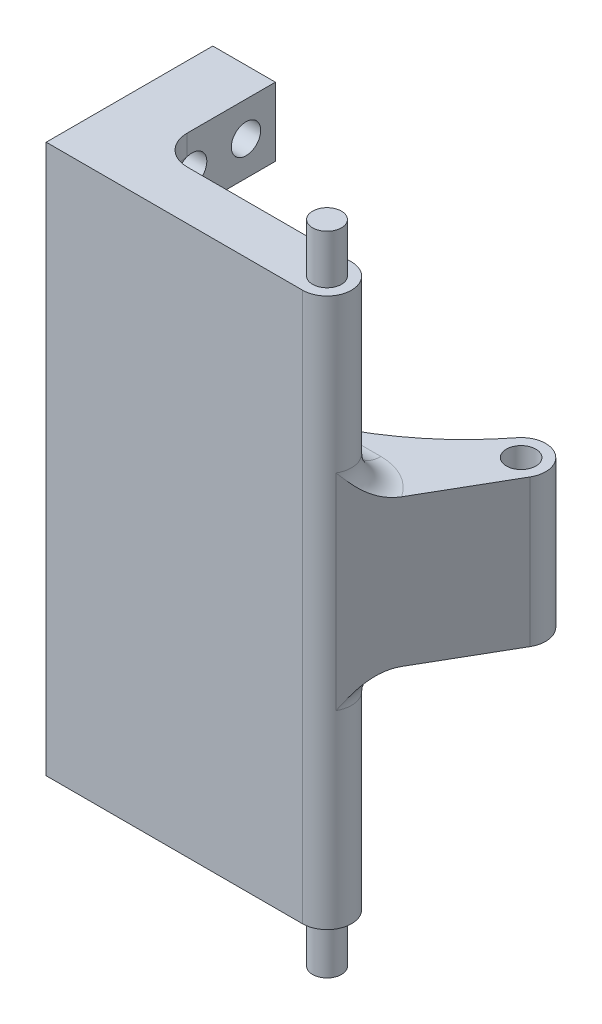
ISO-10303-21;
HEADER;
FILE_DESCRIPTION(('STEP AP214'),'2;1');
FILE_NAME('part.step','',(''),(''),'','','');
FILE_SCHEMA(('AUTOMOTIVE_DESIGN { 1 0 10303 214 1 1 1 1 }'));
ENDSEC;
DATA;
#1=APPLICATION_CONTEXT('core data for automotive mechanical design processes');
#2=APPLICATION_PROTOCOL_DEFINITION('international standard','automotive_design',2000,#1);
#3=PRODUCT_CONTEXT('',#1,'mechanical');
#4=PRODUCT('Part','Part','',(#3));
#5=PRODUCT_RELATED_PRODUCT_CATEGORY('part','',(#4));
#6=PRODUCT_DEFINITION_FORMATION('','',#4);
#7=PRODUCT_DEFINITION_CONTEXT('part definition',#1,'design');
#8=PRODUCT_DEFINITION('design','',#6,#7);
#9=PRODUCT_DEFINITION_SHAPE('','',#8);
#10=(LENGTH_UNIT() NAMED_UNIT(*) SI_UNIT(.MILLI.,.METRE.));
#11=(NAMED_UNIT(*) PLANE_ANGLE_UNIT() SI_UNIT($,.RADIAN.));
#12=(NAMED_UNIT(*) SI_UNIT($,.STERADIAN.) SOLID_ANGLE_UNIT());
#13=UNCERTAINTY_MEASURE_WITH_UNIT(LENGTH_MEASURE(1.E-05),#10,'distance_accuracy_value','');
#14=(GEOMETRIC_REPRESENTATION_CONTEXT(3) GLOBAL_UNCERTAINTY_ASSIGNED_CONTEXT((#13)) GLOBAL_UNIT_ASSIGNED_CONTEXT((#10,
#11,#12)) REPRESENTATION_CONTEXT('',''));
#15=CARTESIAN_POINT('',(0.,0.,0.));
#16=DIRECTION('',(0.,0.,1.));
#17=DIRECTION('',(1.,0.,0.));
#18=AXIS2_PLACEMENT_3D('',#15,#16,#17);
#19=CARTESIAN_POINT('',(0.,28.,0.));
#20=DIRECTION('',(0.,1.,0.));
#21=DIRECTION('',(0.,0.,1.));
#22=AXIS2_PLACEMENT_3D('',#19,#20,#21);
#23=PLANE('',#22);
#24=CARTESIAN_POINT('',(22.27,28.,0.));
#25=DIRECTION('',(0.,1.,0.));
#26=DIRECTION('',(0.,0.,1.));
#27=AXIS2_PLACEMENT_3D('',#24,#25,#26);
#28=CIRCLE('',#27,1.475);
#29=CARTESIAN_POINT('',(22.27,28.,1.47499999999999));
#30=VERTEX_POINT('',#29);
#31=EDGE_CURVE('E671',#30,#30,#28,.T.);
#32=ORIENTED_EDGE('',*,*,#31,.F.);
#33=EDGE_LOOP('',(#32));
#34=FACE_BOUND('',#33,.T.);
#35=CARTESIAN_POINT('',(22.27,28.,0.));
#36=DIRECTION('',(0.,1.,0.));
#37=DIRECTION('',(0.,0.,1.));
#38=AXIS2_PLACEMENT_3D('',#35,#36,#37);
#39=CIRCLE('',#38,2.49999999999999);
#40=CARTESIAN_POINT('',(22.27,28.,2.5));
#41=VERTEX_POINT('',#40);
#42=CARTESIAN_POINT('',(22.27,28.,-2.50000000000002));
#43=VERTEX_POINT('',#42);
#44=EDGE_CURVE('E350',#41,#43,#39,.T.);
#45=ORIENTED_EDGE('',*,*,#44,.T.);
#46=DIRECTION('',(1.,0.,0.));
#47=VECTOR('',#46,1.);
#48=CARTESIAN_POINT('',(0.,28.,-2.5));
#49=LINE('',#48,#47);
#50=CARTESIAN_POINT('',(5.5,28.,-2.50000000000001));
#51=VERTEX_POINT('',#50);
#52=EDGE_CURVE('E354',#51,#43,#49,.T.);
#53=ORIENTED_EDGE('',*,*,#52,.F.);
#54=CARTESIAN_POINT('',(5.49999999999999,28.,-5.50000000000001));
#55=DIRECTION('',(0.,1.,0.));
#56=DIRECTION('',(0.,0.,1.));
#57=AXIS2_PLACEMENT_3D('',#54,#55,#56);
#58=CIRCLE('',#57,3.);
#59=CARTESIAN_POINT('',(2.49999999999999,28.,-5.50000000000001));
#60=VERTEX_POINT('',#59);
#61=EDGE_CURVE('E906',#51,#60,#58,.F.);
#62=ORIENTED_EDGE('',*,*,#61,.T.);
#63=DIRECTION('',(0.,0.,-1.));
#64=VECTOR('',#63,1.);
#65=CARTESIAN_POINT('',(2.49999999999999,28.,0.));
#66=LINE('',#65,#64);
#67=CARTESIAN_POINT('',(2.49999999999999,28.,-14.5));
#68=VERTEX_POINT('',#67);
#69=EDGE_CURVE('E331',#60,#68,#66,.T.);
#70=ORIENTED_EDGE('',*,*,#69,.T.);
#71=DIRECTION('',(1.,0.,0.));
#72=VECTOR('',#71,1.);
#73=CARTESIAN_POINT('',(0.,28.,-14.5));
#74=LINE('',#73,#72);
#75=CARTESIAN_POINT('',(-3.89000000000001,28.,-14.5));
#76=VERTEX_POINT('',#75);
#77=EDGE_CURVE('E335',#76,#68,#74,.T.);
#78=ORIENTED_EDGE('',*,*,#77,.F.);
#79=DIRECTION('',(0.,0.,-1.));
#80=VECTOR('',#79,1.);
#81=CARTESIAN_POINT('',(-3.89,28.,0.));
#82=LINE('',#81,#80);
#83=CARTESIAN_POINT('',(-3.89,28.,2.5));
#84=VERTEX_POINT('',#83);
#85=EDGE_CURVE('E280',#84,#76,#82,.T.);
#86=ORIENTED_EDGE('',*,*,#85,.F.);
#87=DIRECTION('',(1.,0.,0.));
#88=VECTOR('',#87,1.);
#89=CARTESIAN_POINT('',(0.,28.,2.5));
#90=LINE('',#89,#88);
#91=EDGE_CURVE('E347',#84,#41,#90,.T.);
#92=ORIENTED_EDGE('',*,*,#91,.T.);
#93=EDGE_LOOP('',(#45,#53,#62,#70,#78,#86,#92));
#94=FACE_BOUND('',#93,.T.);
#95=ADVANCED_FACE('F57',(#34,#94),#23,.T.);
#96=CARTESIAN_POINT('',(29.5190299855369,-5.7,-12.5593338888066));
#97=DIRECTION('',(0.,1.,0.));
#98=DIRECTION('',(0.,0.,1.));
#99=AXIS2_PLACEMENT_3D('',#96,#97,#98);
#100=CYLINDRICAL_SURFACE('',#99,2.50182282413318);
#101=CARTESIAN_POINT('',(29.5190299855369,-5.7,-12.5593338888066));
#102=DIRECTION('',(0.,1.,0.));
#103=DIRECTION('',(0.,0.,1.));
#104=AXIS2_PLACEMENT_3D('',#101,#102,#103);
#105=CIRCLE('',#104,2.50182282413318);
#106=CARTESIAN_POINT('',(30.6616438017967,-5.7,-14.7849913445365));
#107=VERTEX_POINT('',#106);
#108=CARTESIAN_POINT('',(27.5434014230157,-5.7,-14.0942636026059));
#109=VERTEX_POINT('',#108);
#110=EDGE_CURVE('E646',#107,#109,#105,.T.);
#111=ORIENTED_EDGE('',*,*,#110,.T.);
#112=DIRECTION('',(0.,1.,0.));
#113=VECTOR('',#112,1.);
#114=CARTESIAN_POINT('',(27.5434014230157,-5.7,-14.0942636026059));
#115=LINE('',#114,#113);
#116=CARTESIAN_POINT('',(27.5434014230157,9.3,-14.0942636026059));
#117=VERTEX_POINT('',#116);
#118=EDGE_CURVE('E372',#109,#117,#115,.T.);
#119=ORIENTED_EDGE('',*,*,#118,.T.);
#120=CARTESIAN_POINT('',(29.5190299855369,9.3,-12.5593338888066));
#121=DIRECTION('',(0.,1.,0.));
#122=DIRECTION('',(0.,0.,1.));
#123=AXIS2_PLACEMENT_3D('',#120,#121,#122);
#124=CIRCLE('',#123,2.50182282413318);
#125=CARTESIAN_POINT('',(30.6616438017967,9.3,-14.7849913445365));
#126=VERTEX_POINT('',#125);
#127=EDGE_CURVE('E242',#126,#117,#124,.T.);
#128=ORIENTED_EDGE('',*,*,#127,.F.);
#129=DIRECTION('',(0.,1.,0.));
#130=VECTOR('',#129,1.);
#131=CARTESIAN_POINT('',(30.6616438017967,-5.7,-14.7849913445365));
#132=LINE('',#131,#130);
#133=EDGE_CURVE('E259',#107,#126,#132,.T.);
#134=ORIENTED_EDGE('',*,*,#133,.F.);
#135=EDGE_LOOP('',(#111,#119,#128,#134));
#136=FACE_BOUND('',#135,.T.);
#137=ADVANCED_FACE('F478',(#136),#100,.T.);
#138=CARTESIAN_POINT('',(14.0675000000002,-5.7,-24.3656247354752));
#139=DIRECTION('',(-0.500000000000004,0.,0.866025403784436));
#140=DIRECTION('',(0.866025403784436,0.,0.500000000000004));
#141=AXIS2_PLACEMENT_3D('',#138,#139,#140);
#142=PLANE('',#141);
#143=DIRECTION('',(0.866025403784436,0.,0.500000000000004));
#144=VECTOR('',#143,1.);
#145=CARTESIAN_POINT('',(14.0675000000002,9.3,-24.3656247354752));
#146=LINE('',#145,#144);
#147=CARTESIAN_POINT('',(30.8751989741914,9.3,-14.6616952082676));
#148=VERTEX_POINT('',#147);
#149=EDGE_CURVE('E253',#126,#148,#146,.T.);
#150=ORIENTED_EDGE('',*,*,#149,.T.);
#151=DIRECTION('',(0.,1.,0.));
#152=VECTOR('',#151,1.);
#153=CARTESIAN_POINT('',(30.8751989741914,-5.7,-14.6616952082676));
#154=LINE('',#153,#152);
#155=CARTESIAN_POINT('',(30.8751989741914,-5.7,-14.6616952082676));
#156=VERTEX_POINT('',#155);
#157=EDGE_CURVE('E252',#156,#148,#154,.T.);
#158=ORIENTED_EDGE('',*,*,#157,.F.);
#159=DIRECTION('',(0.866025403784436,0.,0.500000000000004));
#160=VECTOR('',#159,1.);
#161=CARTESIAN_POINT('',(14.0675000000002,-5.7,-24.3656247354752));
#162=LINE('',#161,#160);
#163=EDGE_CURVE('E261',#107,#156,#162,.T.);
#164=ORIENTED_EDGE('',*,*,#163,.F.);
#165=ORIENTED_EDGE('',*,*,#133,.T.);
#166=EDGE_LOOP('',(#150,#158,#164,#165));
#167=FACE_BOUND('',#166,.T.);
#168=ADVANCED_FACE('F483',(#167),#142,.F.);
#169=ORIENTED_EDGE('',*,*,#157,.T.);
#170=CARTESIAN_POINT('',(31.685672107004,9.3,-11.30842247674));
#171=VERTEX_POINT('',#170);
#172=EDGE_CURVE('E236',#171,#148,#124,.T.);
#173=ORIENTED_EDGE('',*,*,#172,.F.);
#174=DIRECTION('',(0.,1.,0.));
#175=VECTOR('',#174,1.);
#176=CARTESIAN_POINT('',(31.685672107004,-5.7,-11.30842247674));
#177=LINE('',#176,#175);
#178=CARTESIAN_POINT('',(31.685672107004,-5.7,-11.30842247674));
#179=VERTEX_POINT('',#178);
#180=EDGE_CURVE('E249',#179,#171,#177,.T.);
#181=ORIENTED_EDGE('',*,*,#180,.F.);
#182=EDGE_CURVE('E649',#179,#156,#105,.T.);
#183=ORIENTED_EDGE('',*,*,#182,.T.);
#184=EDGE_LOOP('',(#169,#173,#181,#183));
#185=FACE_BOUND('',#184,.T.);
#186=ADVANCED_FACE('F247',(#185),#100,.T.);
#187=CARTESIAN_POINT('',(18.867563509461,-5.7,10.8931928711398));
#188=DIRECTION('',(0.866025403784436,0.,0.500000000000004));
#189=DIRECTION('',(0.500000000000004,0.,-0.866025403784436));
#190=AXIS2_PLACEMENT_3D('',#187,#188,#189);
#191=PLANE('',#190);
#192=ORIENTED_EDGE('',*,*,#180,.T.);
#193=DIRECTION('',(0.500000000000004,0.,-0.866025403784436));
#194=VECTOR('',#193,1.);
#195=CARTESIAN_POINT('',(18.867563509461,9.3,10.8931928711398));
#196=LINE('',#195,#194);
#197=CARTESIAN_POINT('',(26.8845532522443,9.3,-2.99264068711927));
#198=VERTEX_POINT('',#197);
#199=EDGE_CURVE('E232',#198,#171,#196,.T.);
#200=ORIENTED_EDGE('',*,*,#199,.F.);
#201=CARTESIAN_POINT('',(26.8845532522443,9.3,-2.99264068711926));
#202=CARTESIAN_POINT('',(26.8257385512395,9.29998241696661,-2.89077063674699));
#203=CARTESIAN_POINT('',(26.7669508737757,9.3054867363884,-2.78894739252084));
#204=CARTESIAN_POINT('',(26.6499223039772,9.32689735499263,-2.58624796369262));
#205=CARTESIAN_POINT('',(26.591680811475,9.34279041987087,-2.48537073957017));
#206=CARTESIAN_POINT('',(26.4766843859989,9.3841246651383,-2.2861910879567));
#207=CARTESIAN_POINT('',(26.4199203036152,9.40946523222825,-2.18787281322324));
#208=CARTESIAN_POINT('',(26.3075525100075,9.46901605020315,-1.99324608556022));
#209=CARTESIAN_POINT('',(26.2519492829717,9.50322992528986,-1.89693847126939));
#210=CARTESIAN_POINT('',(26.124537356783,9.59208526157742,-1.67625454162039));
#211=CARTESIAN_POINT('',(26.0532554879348,9.64975859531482,-1.55279072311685));
#212=CARTESIAN_POINT('',(25.9135447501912,9.77753907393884,-1.31080462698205));
#213=CARTESIAN_POINT('',(25.8451166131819,9.84764938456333,-1.19228361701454));
#214=CARTESIAN_POINT('',(25.7110344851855,9.99881806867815,-0.960046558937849));
#215=CARTESIAN_POINT('',(25.6453918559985,10.0799165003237,-0.8463501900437));
#216=CARTESIAN_POINT('',(25.5171151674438,10.2511599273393,-0.624168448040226));
#217=CARTESIAN_POINT('',(25.4544822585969,10.3413083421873,-0.515685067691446));
#218=CARTESIAN_POINT('',(25.3051106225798,10.5703436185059,-0.256965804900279));
#219=CARTESIAN_POINT('',(25.2199029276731,10.7132109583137,-0.109381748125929));
#220=CARTESIAN_POINT('',(25.0543956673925,11.0098770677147,0.177285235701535));
#221=CARTESIAN_POINT('',(24.9740985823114,11.163681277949,0.316363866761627));
#222=CARTESIAN_POINT('',(24.7385384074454,11.6354021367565,0.72436605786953));
#223=CARTESIAN_POINT('',(24.5885669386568,11.9636931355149,0.984124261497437));
#224=CARTESIAN_POINT('',(24.4375253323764,12.2946064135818,1.24573599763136));
#225=CARTESIAN_POINT('',(24.4362944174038,12.2973032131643,1.24786800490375));
#226=CARTESIAN_POINT('',(24.4350635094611,12.3,1.25));
#227=B_SPLINE_CURVE_WITH_KNOTS('',3,(#201,#202,#203,#204,#205,#206,#207,#208,#209,#210,#211,
#212,#213,#214,#215,#216,#217,#218,#219,#220,#221,#222,#223,#224,#225,#226),.UNSPECIFIED.,.F.,
.F.,(4,2,2,2,2,2,2,2,2,2,2,2,4),(0.,0.352679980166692,0.704911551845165,1.05349439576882,
1.40221983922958,1.86287496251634,2.32364751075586,2.78614746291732,3.24882283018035,
3.91525218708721,4.58201541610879,5.91523448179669,5.92618893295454),.UNSPECIFIED.);
#228=CARTESIAN_POINT('',(24.4350635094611,12.3,1.24999999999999));
#229=VERTEX_POINT('',#228);
#230=EDGE_CURVE('E12',#198,#229,#227,.T.);
#231=ORIENTED_EDGE('',*,*,#230,.T.);
#232=DIRECTION('',(0.,1.,0.));
#233=VECTOR('',#232,1.);
#234=CARTESIAN_POINT('',(24.4350635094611,-5.7,1.24999999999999));
#235=LINE('',#234,#233);
#236=CARTESIAN_POINT('',(24.4350635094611,-8.7,1.24999999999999));
#237=VERTEX_POINT('',#236);
#238=EDGE_CURVE('E78',#237,#229,#235,.T.);
#239=ORIENTED_EDGE('',*,*,#238,.F.);
#240=CARTESIAN_POINT('',(26.8845532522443,-5.7,-2.99264068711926));
#241=CARTESIAN_POINT('',(26.8257385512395,-5.69998241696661,-2.89077063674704));
#242=CARTESIAN_POINT('',(26.7669508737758,-5.70548673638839,-2.78894739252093));
#243=CARTESIAN_POINT('',(26.6499223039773,-5.7268973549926,-2.58624796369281));
#244=CARTESIAN_POINT('',(26.5916808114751,-5.74279041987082,-2.4853707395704));
#245=CARTESIAN_POINT('',(26.476684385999,-5.78412466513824,-2.28619108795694));
#246=CARTESIAN_POINT('',(26.4199203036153,-5.8094652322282,-2.18787281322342));
#247=CARTESIAN_POINT('',(26.3075525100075,-5.86901605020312,-1.99324608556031));
#248=CARTESIAN_POINT('',(26.2519492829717,-5.90322992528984,-1.89693847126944));
#249=CARTESIAN_POINT('',(26.124537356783,-5.99208526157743,-1.67625454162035));
#250=CARTESIAN_POINT('',(26.0532554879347,-6.04975859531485,-1.55279072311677));
#251=CARTESIAN_POINT('',(25.9135447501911,-6.17753907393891,-1.31080462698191));
#252=CARTESIAN_POINT('',(25.8451166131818,-6.24764938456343,-1.19228361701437));
#253=CARTESIAN_POINT('',(25.7110344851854,-6.39881806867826,-0.960046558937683));
#254=CARTESIAN_POINT('',(25.6453918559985,-6.47991650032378,-0.846350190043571));
#255=CARTESIAN_POINT('',(25.5171151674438,-6.65115992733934,-0.624168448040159));
#256=CARTESIAN_POINT('',(25.4544822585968,-6.74130834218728,-0.515685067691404));
#257=CARTESIAN_POINT('',(25.3051106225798,-6.9703436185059,-0.256965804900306));
#258=CARTESIAN_POINT('',(25.2199029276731,-7.11321095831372,-0.109381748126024));
#259=CARTESIAN_POINT('',(25.0543956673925,-7.40987706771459,0.177285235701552));
#260=CARTESIAN_POINT('',(24.9740985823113,-7.56368127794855,0.316363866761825));
#261=CARTESIAN_POINT('',(24.7385384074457,-8.03540213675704,0.724366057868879));
#262=CARTESIAN_POINT('',(24.5885669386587,-8.36369313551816,0.984124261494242));
#263=CARTESIAN_POINT('',(24.4375253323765,-8.69460641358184,1.24573599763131));
#264=CARTESIAN_POINT('',(24.4362944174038,-8.69730321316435,1.24786800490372));
#265=CARTESIAN_POINT('',(24.4350635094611,-8.7,1.25));
#266=B_SPLINE_CURVE_WITH_KNOTS('',3,(#240,#241,#242,#243,#244,#245,#246,#247,#248,#249,#250,
#251,#252,#253,#254,#255,#256,#257,#258,#259,#260,#261,#262,#263,#264,#265),.UNSPECIFIED.,.F.,
.F.,(4,2,2,2,2,2,2,2,2,2,2,2,4),(0.,0.35267998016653,0.704911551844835,1.05349439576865,
1.40221983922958,1.86287496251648,2.32364751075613,2.78614746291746,3.24882283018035,
3.91525218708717,4.58201541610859,5.91523448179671,5.92618893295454),.UNSPECIFIED.);
#267=CARTESIAN_POINT('',(26.8845532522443,-5.7,-2.99264068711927));
#268=VERTEX_POINT('',#267);
#269=EDGE_CURVE('E71',#237,#268,#266,.F.);
#270=ORIENTED_EDGE('',*,*,#269,.T.);
#271=DIRECTION('',(0.500000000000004,0.,-0.866025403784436));
#272=VECTOR('',#271,1.);
#273=CARTESIAN_POINT('',(18.867563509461,-5.7,10.8931928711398));
#274=LINE('',#273,#272);
#275=EDGE_CURVE('E257',#268,#179,#274,.T.);
#276=ORIENTED_EDGE('',*,*,#275,.T.);
#277=EDGE_LOOP('',(#192,#200,#231,#239,#270,#276));
#278=FACE_BOUND('',#277,.T.);
#279=ADVANCED_FACE('F255',(#278),#191,.T.);
#280=CARTESIAN_POINT('',(29.5190299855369,-5.7,-12.5593338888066));
#281=DIRECTION('',(0.,1.,0.));
#282=DIRECTION('',(0.,0.,1.));
#283=AXIS2_PLACEMENT_3D('',#280,#281,#282);
#284=CYLINDRICAL_SURFACE('',#283,1.5);
#285=CARTESIAN_POINT('',(29.5190299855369,-5.7,-12.5593338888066));
#286=DIRECTION('',(0.,1.,0.));
#287=DIRECTION('',(0.,0.,1.));
#288=AXIS2_PLACEMENT_3D('',#285,#286,#287);
#289=CIRCLE('',#288,1.5);
#290=CARTESIAN_POINT('',(29.5190299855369,-5.7,-11.0593338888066));
#291=VERTEX_POINT('',#290);
#292=EDGE_CURVE('E642',#291,#291,#289,.T.);
#293=ORIENTED_EDGE('',*,*,#292,.F.);
#294=EDGE_LOOP('',(#293));
#295=FACE_BOUND('',#294,.T.);
#296=CARTESIAN_POINT('',(29.5190299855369,9.3,-12.5593338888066));
#297=DIRECTION('',(0.,1.,0.));
#298=DIRECTION('',(0.,0.,1.));
#299=AXIS2_PLACEMENT_3D('',#296,#297,#298);
#300=CIRCLE('',#299,1.5);
#301=CARTESIAN_POINT('',(29.5190299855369,9.3,-11.0593338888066));
#302=VERTEX_POINT('',#301);
#303=EDGE_CURVE('E666',#302,#302,#300,.T.);
#304=ORIENTED_EDGE('',*,*,#303,.T.);
#305=EDGE_LOOP('',(#304));
#306=FACE_BOUND('',#305,.T.);
#307=ADVANCED_FACE('F610',(#295,#306),#284,.F.);
#308=CARTESIAN_POINT('',(22.27,28.,0.));
#309=DIRECTION('',(0.,-1.,0.));
#310=DIRECTION('',(0.,0.,-1.));
#311=AXIS2_PLACEMENT_3D('',#308,#309,#310);
#312=CYLINDRICAL_SURFACE('',#311,2.49999999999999);
#313=DIRECTION('',(0.,-1.,0.));
#314=VECTOR('',#313,1.);
#315=CARTESIAN_POINT('',(22.27,28.,-2.50000000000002));
#316=LINE('',#315,#314);
#317=CARTESIAN_POINT('',(22.27,-8.7,-2.50000000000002));
#318=VERTEX_POINT('',#317);
#319=CARTESIAN_POINT('',(22.27,-28.,-2.50000000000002));
#320=VERTEX_POINT('',#319);
#321=EDGE_CURVE('E357',#318,#320,#316,.T.);
#322=ORIENTED_EDGE('',*,*,#321,.F.);
#323=CARTESIAN_POINT('',(22.27,-8.7,0.));
#324=DIRECTION('',(0.,1.,0.));
#325=DIRECTION('',(0.,0.,1.));
#326=AXIS2_PLACEMENT_3D('',#323,#324,#325);
#327=CIRCLE('',#326,2.49999999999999);
#328=EDGE_CURVE('E560',#318,#237,#327,.F.);
#329=ORIENTED_EDGE('',*,*,#328,.T.);
#330=ORIENTED_EDGE('',*,*,#238,.T.);
#331=CARTESIAN_POINT('',(22.27,12.3,0.));
#332=DIRECTION('',(0.,1.,0.));
#333=DIRECTION('',(0.,0.,1.));
#334=AXIS2_PLACEMENT_3D('',#331,#332,#333);
#335=CIRCLE('',#334,2.49999999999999);
#336=CARTESIAN_POINT('',(22.27,12.3,-2.50000000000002));
#337=VERTEX_POINT('',#336);
#338=EDGE_CURVE('E557',#229,#337,#335,.T.);
#339=ORIENTED_EDGE('',*,*,#338,.T.);
#340=DIRECTION('',(0.,1.,0.));
#341=VECTOR('',#340,1.);
#342=CARTESIAN_POINT('',(22.27,9.3,-2.50000000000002));
#343=LINE('',#342,#341);
#344=EDGE_CURVE('E640',#337,#43,#343,.T.);
#345=ORIENTED_EDGE('',*,*,#344,.T.);
#346=ORIENTED_EDGE('',*,*,#44,.F.);
#347=DIRECTION('',(0.,-1.,0.));
#348=VECTOR('',#347,1.);
#349=CARTESIAN_POINT('',(22.27,28.,2.5));
#350=LINE('',#349,#348);
#351=CARTESIAN_POINT('',(22.27,-28.,2.5));
#352=VERTEX_POINT('',#351);
#353=EDGE_CURVE('E366',#41,#352,#350,.T.);
#354=ORIENTED_EDGE('',*,*,#353,.T.);
#355=CARTESIAN_POINT('',(22.27,-28.,0.));
#356=DIRECTION('',(0.,1.,0.));
#357=DIRECTION('',(0.,0.,1.));
#358=AXIS2_PLACEMENT_3D('',#355,#356,#357);
#359=CIRCLE('',#358,2.49999999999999);
#360=EDGE_CURVE('E360',#352,#320,#359,.T.);
#361=ORIENTED_EDGE('',*,*,#360,.T.);
#362=EDGE_LOOP('',(#322,#329,#330,#339,#345,#346,#354,#361));
#363=FACE_BOUND('',#362,.T.);
#364=ADVANCED_FACE('F409',(#363),#312,.T.);
#365=CARTESIAN_POINT('',(0.,28.,-2.5));
#366=DIRECTION('',(0.,0.,-1.));
#367=DIRECTION('',(-1.,0.,0.));
#368=AXIS2_PLACEMENT_3D('',#365,#366,#367);
#369=PLANE('',#368);
#370=DIRECTION('',(0.,-1.,0.));
#371=VECTOR('',#370,1.);
#372=CARTESIAN_POINT('',(3.85313195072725,-5.7,-2.50000000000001));
#373=LINE('',#372,#371);
#374=CARTESIAN_POINT('',(3.85313195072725,12.3,-2.50000000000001));
#375=VERTEX_POINT('',#374);
#376=CARTESIAN_POINT('',(3.85313195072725,-8.7,-2.5));
#377=VERTEX_POINT('',#376);
#378=EDGE_CURVE('E375',#375,#377,#373,.T.);
#379=ORIENTED_EDGE('',*,*,#378,.T.);
#380=DIRECTION('',(-1.,0.,0.));
#381=VECTOR('',#380,1.);
#382=CARTESIAN_POINT('',(0.,-8.7,-2.5));
#383=LINE('',#382,#381);
#384=EDGE_CURVE('E917',#377,#318,#383,.F.);
#385=ORIENTED_EDGE('',*,*,#384,.T.);
#386=ORIENTED_EDGE('',*,*,#321,.T.);
#387=DIRECTION('',(1.,0.,0.));
#388=VECTOR('',#387,1.);
#389=CARTESIAN_POINT('',(0.,-28.,-2.5));
#390=LINE('',#389,#388);
#391=CARTESIAN_POINT('',(5.5,-28.,-2.50000000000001));
#392=VERTEX_POINT('',#391);
#393=EDGE_CURVE('E351',#392,#320,#390,.T.);
#394=ORIENTED_EDGE('',*,*,#393,.F.);
#395=DIRECTION('',(0.,-1.,0.));
#396=VECTOR('',#395,1.);
#397=CARTESIAN_POINT('',(5.5,-21.,-2.50000000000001));
#398=LINE('',#397,#396);
#399=CARTESIAN_POINT('',(5.49999999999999,-25.9142135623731,-2.50000000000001));
#400=VERTEX_POINT('',#399);
#401=EDGE_CURVE('E397',#392,#400,#398,.F.);
#402=ORIENTED_EDGE('',*,*,#401,.T.);
#403=CARTESIAN_POINT('',(5.41785978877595,-26.6395579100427,-2.50000000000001));
#404=CARTESIAN_POINT('',(2.33707020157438,-25.9227357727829,-2.5));
#405=CARTESIAN_POINT('',(2.49999999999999,-25.9606454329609,-5.65865718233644));
#406=CARTESIAN_POINT('',(5.42756827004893,-26.597837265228,-2.50000000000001));
#407=CARTESIAN_POINT('',(2.34336804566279,-25.9250910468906,-2.5));
#408=CARTESIAN_POINT('',(2.49999999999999,-25.9591665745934,-5.65234054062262));
#409=CARTESIAN_POINT('',(5.43640968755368,-26.5559156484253,-2.50000000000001));
#410=CARTESIAN_POINT('',(2.35013721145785,-25.9271362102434,-2.5));
#411=CARTESIAN_POINT('',(2.49999999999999,-25.9575654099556,-5.64566308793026));
#412=CARTESIAN_POINT('',(5.45236097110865,-26.4717471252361,-2.50000000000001));
#413=CARTESIAN_POINT('',(2.36471398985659,-25.930420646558,-2.5));
#414=CARTESIAN_POINT('',(2.49999999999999,-25.9540346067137,-5.63143626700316));
#415=CARTESIAN_POINT('',(5.45947095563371,-26.4295002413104,-2.50000000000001));
#416=CARTESIAN_POINT('',(2.37251680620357,-25.9316614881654,-2.5));
#417=CARTESIAN_POINT('',(2.49999999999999,-25.9521049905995,-5.62388695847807));
#418=CARTESIAN_POINT('',(5.47198812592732,-26.3445835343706,-2.50000000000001));
#419=CARTESIAN_POINT('',(2.3892913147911,-25.9331658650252,-2.5));
#420=CARTESIAN_POINT('',(2.49999999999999,-25.9478247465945,-5.6077332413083));
#421=CARTESIAN_POINT('',(5.47738842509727,-26.3019126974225,-2.50000000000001));
#422=CARTESIAN_POINT('',(2.39826153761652,-25.933428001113,-2.5));
#423=CARTESIAN_POINT('',(2.49999999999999,-25.9454724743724,-5.59912475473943));
#424=CARTESIAN_POINT('',(5.48646028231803,-26.2163868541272,-2.50000000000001));
#425=CARTESIAN_POINT('',(2.41746814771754,-25.9327322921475,-2.5));
#426=CARTESIAN_POINT('',(2.49999999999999,-25.9402294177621,-5.58067734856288));
#427=CARTESIAN_POINT('',(5.49013179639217,-26.173531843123,-2.50000000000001));
#428=CARTESIAN_POINT('',(2.42769666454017,-25.9317784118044,-2.5));
#429=CARTESIAN_POINT('',(2.49999999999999,-25.9373386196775,-5.57083839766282));
#430=CARTESIAN_POINT('',(5.49574290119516,-26.0880782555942,-2.50000000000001));
#431=CARTESIAN_POINT('',(2.44946712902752,-25.9283760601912,-2.5));
#432=CARTESIAN_POINT('',(2.49999999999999,-25.9308799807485,-5.54977428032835));
#433=CARTESIAN_POINT('',(5.49769707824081,-26.0454806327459,-2.50000000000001));
#434=CARTESIAN_POINT('',(2.46098663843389,-25.9259466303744,-2.5));
#435=CARTESIAN_POINT('',(2.49999999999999,-25.9273181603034,-5.53856172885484));
#436=CARTESIAN_POINT('',(5.49995859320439,-25.9602443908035,-2.50000000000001));
#437=CARTESIAN_POINT('',(2.48556949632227,-25.9192419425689,-2.5));
#438=CARTESIAN_POINT('',(2.49999999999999,-25.9192734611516,-5.51438170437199));
#439=CARTESIAN_POINT('',(5.50026601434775,-25.9176057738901,-2.50000000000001));
#440=CARTESIAN_POINT('',(2.49861958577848,-25.9149761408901,-2.5));
#441=CARTESIAN_POINT('',(2.49999999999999,-25.9147906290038,-5.50141432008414));
#442=CARTESIAN_POINT('',(5.49928043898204,-25.8324502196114,-2.50000000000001));
#443=CARTESIAN_POINT('',(2.52641909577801,-25.9041459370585,-2.5));
#444=CARTESIAN_POINT('',(2.49999999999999,-25.9045963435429,-5.47337492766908));
#445=CARTESIAN_POINT('',(5.49799129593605,-25.7899332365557,-2.50000000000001));
#446=CARTESIAN_POINT('',(2.54114687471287,-25.8976014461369,-2.5));
#447=CARTESIAN_POINT('',(2.49999999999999,-25.8988878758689,-5.45830806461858));
#448=CARTESIAN_POINT('',(5.4938833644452,-25.7049683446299,-2.50000000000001));
#449=CARTESIAN_POINT('',(2.57254361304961,-25.8815842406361,-2.5));
#450=CARTESIAN_POINT('',(2.49999999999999,-25.8857566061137,-5.4255579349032));
#451=CARTESIAN_POINT('',(5.49106433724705,-25.6625204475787,-2.50000000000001));
#452=CARTESIAN_POINT('',(2.58918987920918,-25.8721331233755,-2.5));
#453=CARTESIAN_POINT('',(2.49999999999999,-25.8783335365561,-5.4078742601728));
#454=CARTESIAN_POINT('',(5.48223183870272,-25.5568398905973,-2.50000000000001));
#455=CARTESIAN_POINT('',(2.63333801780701,-25.8439975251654,-2.5));
#456=CARTESIAN_POINT('',(2.49999999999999,-25.8568927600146,-5.35978040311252));
#457=CARTESIAN_POINT('',(5.47532861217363,-25.4936801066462,-2.50000000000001));
#458=CARTESIAN_POINT('',(2.66216032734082,-25.8230886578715,-2.5));
#459=CARTESIAN_POINT('',(2.49999999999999,-25.8414281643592,-5.32739468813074));
#460=CARTESIAN_POINT('',(5.46289602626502,-25.3992399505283,-2.50000000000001));
#461=CARTESIAN_POINT('',(2.70977915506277,-25.7823456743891,-2.5));
#462=CARTESIAN_POINT('',(2.49999999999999,-25.8113734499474,-5.27148857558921));
#463=CARTESIAN_POINT('',(5.45840661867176,-25.3678159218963,-2.50000000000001));
#464=CARTESIAN_POINT('',(2.72628149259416,-25.767304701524,-2.5));
#465=CARTESIAN_POINT('',(2.49999999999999,-25.8002150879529,-5.25163653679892));
#466=CARTESIAN_POINT('',(5.44882220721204,-25.3050602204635,-2.50000000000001));
#467=CARTESIAN_POINT('',(2.76075290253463,-25.7334157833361,-2.5));
#468=CARTESIAN_POINT('',(2.49999999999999,-25.774790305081,-5.20909505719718));
#469=CARTESIAN_POINT('',(5.443727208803,-25.2737285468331,-2.50000000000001));
#470=CARTESIAN_POINT('',(2.77869870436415,-25.714606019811,-2.5));
#471=CARTESIAN_POINT('',(2.49999999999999,-25.7605239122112,-5.18640564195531));
#472=CARTESIAN_POINT('',(5.43304753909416,-25.211182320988,-2.50000000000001));
#473=CARTESIAN_POINT('',(2.81604166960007,-25.6723187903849,-2.5));
#474=CARTESIAN_POINT('',(2.49999999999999,-25.7278194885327,-5.13784165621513));
#475=CARTESIAN_POINT('',(5.42746336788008,-25.1799676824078,-2.50000000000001));
#476=CARTESIAN_POINT('',(2.83541029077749,-25.6488984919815,-2.5));
#477=CARTESIAN_POINT('',(2.49999999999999,-25.7093856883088,-5.11197032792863));
#478=CARTESIAN_POINT('',(5.41595104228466,-25.1176026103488,-2.50000000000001));
#479=CARTESIAN_POINT('',(2.8754983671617,-25.5962732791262,-2.50000000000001));
#480=CARTESIAN_POINT('',(2.49999999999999,-25.6668312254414,-5.05674783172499));
#481=CARTESIAN_POINT('',(5.41002288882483,-25.086452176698,-2.50000000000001));
#482=CARTESIAN_POINT('',(2.89618867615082,-25.5671387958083,-2.5));
#483=CARTESIAN_POINT('',(2.49999999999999,-25.6427105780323,-5.02739667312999));
#484=CARTESIAN_POINT('',(5.39801558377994,-25.0241209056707,-2.50000000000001));
#485=CARTESIAN_POINT('',(2.93862207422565,-25.5017015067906,-2.5));
#486=CARTESIAN_POINT('',(2.49999999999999,-25.5866884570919,-4.96517214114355));
#487=CARTESIAN_POINT('',(5.39193617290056,-24.9929401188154,-2.50000000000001));
#488=CARTESIAN_POINT('',(2.96034006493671,-25.4654761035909,-2.5));
#489=CARTESIAN_POINT('',(2.49999999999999,-25.5547726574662,-4.932292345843));
#490=CARTESIAN_POINT('',(5.3799175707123,-24.9305495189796,-2.50000000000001));
#491=CARTESIAN_POINT('',(3.00406946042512,-25.3844249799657,-2.5));
#492=CARTESIAN_POINT('',(2.49999999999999,-25.4805587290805,-4.86375072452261));
#493=CARTESIAN_POINT('',(5.37397838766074,-24.8993397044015,-2.50000000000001));
#494=CARTESIAN_POINT('',(3.02606439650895,-25.3397052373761,-2.5));
#495=CARTESIAN_POINT('',(2.49999999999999,-25.4382599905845,-4.8280887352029));
#496=CARTESIAN_POINT('',(5.36245742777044,-24.8359353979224,-2.50000000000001));
#497=CARTESIAN_POINT('',(3.06963746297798,-25.2388905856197,-2.5));
#498=CARTESIAN_POINT('',(2.49999999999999,-25.3388819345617,-4.75493605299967));
#499=CARTESIAN_POINT('',(5.35689056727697,-24.8037380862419,-2.50000000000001));
#500=CARTESIAN_POINT('',(3.09120117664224,-25.1826015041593,-2.5));
#501=CARTESIAN_POINT('',(2.49999999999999,-25.2814173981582,-4.71742218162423));
#502=CARTESIAN_POINT('',(5.34934843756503,-24.7553140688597,-2.50000000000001));
#503=CARTESIAN_POINT('',(3.12106019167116,-25.0896551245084,-2.5));
#504=CARTESIAN_POINT('',(2.49999999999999,-25.1828299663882,-4.66391319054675));
#505=CARTESIAN_POINT('',(5.34696903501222,-24.7391509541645,-2.50000000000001));
#506=CARTESIAN_POINT('',(3.13057423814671,-25.0573686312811,-2.5));
#507=CARTESIAN_POINT('',(2.49999999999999,-25.1479012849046,-4.6465367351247));
#508=CARTESIAN_POINT('',(5.34255426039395,-24.7067781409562,-2.50000000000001));
#509=CARTESIAN_POINT('',(3.14838394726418,-24.9901687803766,-2.5));
#510=CARTESIAN_POINT('',(2.49999999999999,-25.0739100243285,-4.61354043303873));
#511=CARTESIAN_POINT('',(5.34051887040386,-24.690568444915,-2.50000000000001));
#512=CARTESIAN_POINT('',(3.15668910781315,-24.9552506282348,-2.5));
#513=CARTESIAN_POINT('',(2.49999999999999,-25.0348476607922,-4.59792049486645));
#514=CARTESIAN_POINT('',(5.33687218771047,-24.658168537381,-2.50000000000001));
#515=CARTESIAN_POINT('',(3.1716768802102,-24.8832014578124,-2.5));
#516=CARTESIAN_POINT('',(2.49999999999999,-24.9530156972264,-4.5693906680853));
#517=CARTESIAN_POINT('',(5.33525918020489,-24.6419785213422,-2.50000000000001));
#518=CARTESIAN_POINT('',(3.17837682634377,-24.8460643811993,-2.5));
#519=CARTESIAN_POINT('',(2.49999999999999,-24.9102620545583,-4.55646986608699));
#520=CARTESIAN_POINT('',(5.33251196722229,-24.6095575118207,-2.50000000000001));
#521=CARTESIAN_POINT('',(3.18984301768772,-24.7699134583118,-2.5));
#522=CARTESIAN_POINT('',(2.49999999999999,-24.8215500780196,-4.534157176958));
#523=CARTESIAN_POINT('',(5.33137775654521,-24.593326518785,-2.50000000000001));
#524=CARTESIAN_POINT('',(3.19461989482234,-24.7308705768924,-2.5));
#525=CARTESIAN_POINT('',(2.49999999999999,-24.77559177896,-4.52476525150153));
#526=CARTESIAN_POINT('',(5.32963948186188,-24.5608404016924,-2.50000000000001));
#527=CARTESIAN_POINT('',(3.20195591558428,-24.6515679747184,-2.5));
#528=CARTESIAN_POINT('',(2.49999999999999,-24.681508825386,-4.51026273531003));
#529=CARTESIAN_POINT('',(5.32903526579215,-24.5445852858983,-2.50000000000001));
#530=CARTESIAN_POINT('',(3.20452367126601,-24.6112681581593,-2.5));
#531=CARTESIAN_POINT('',(2.49999999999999,-24.6333847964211,-4.50515091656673));
#532=CARTESIAN_POINT('',(5.32838557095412,-24.5120637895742,-2.50000000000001));
#533=CARTESIAN_POINT('',(3.20728209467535,-24.5302292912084,-2.5));
#534=CARTESIAN_POINT('',(2.49999999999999,-24.5362903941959,-4.49965120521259));
#535=CARTESIAN_POINT('',(5.32834008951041,-24.4957974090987,-2.50000000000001));
#536=CARTESIAN_POINT('',(3.20747603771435,-24.4894426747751,-2.50000000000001));
#537=CARTESIAN_POINT('',(2.49999999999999,-24.4873200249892,-4.49926328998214));
#538=CARTESIAN_POINT('',(5.32881053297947,-24.4632436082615,-2.50000000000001));
#539=CARTESIAN_POINT('',(3.20547775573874,-24.4081975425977,-2.50000000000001));
#540=CARTESIAN_POINT('',(2.49999999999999,-24.3899059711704,-4.50325000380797));
#541=CARTESIAN_POINT('',(5.32932746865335,-24.4469562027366,-2.50000000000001));
#542=CARTESIAN_POINT('',(3.20327884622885,-24.3676914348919,-2.5));
#543=CARTESIAN_POINT('',(2.49999999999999,-24.3414633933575,-4.507633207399));
#544=CARTESIAN_POINT('',(5.33089916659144,-24.4144076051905,-2.50000000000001));
#545=CARTESIAN_POINT('',(3.19663709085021,-24.2878764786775,-2.5));
#546=CARTESIAN_POINT('',(2.49999999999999,-24.2465682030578,-4.52078774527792));
#547=CARTESIAN_POINT('',(5.33195393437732,-24.3981464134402,-2.50000000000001));
#548=CARTESIAN_POINT('',(3.19218683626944,-24.2485254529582,-2.5));
#549=CARTESIAN_POINT('',(2.49999999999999,-24.2001156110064,-4.5295591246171));
#550=CARTESIAN_POINT('',(5.3345533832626,-24.3656582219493,-2.50000000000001));
#551=CARTESIAN_POINT('',(3.18131509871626,-24.1716649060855,-2.5));
#552=CARTESIAN_POINT('',(2.49999999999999,-24.1102733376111,-4.55077709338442));
#553=CARTESIAN_POINT('',(5.33609823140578,-24.349431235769,-2.50000000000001));
#554=CARTESIAN_POINT('',(3.1748825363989,-24.1341248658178,-2.5));
#555=CARTESIAN_POINT('',(2.49999999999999,-24.0668847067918,-4.56322493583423));
#556=CARTESIAN_POINT('',(5.33961358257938,-24.3170239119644,-2.50000000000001));
#557=CARTESIAN_POINT('',(3.16039607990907,-24.0613706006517,-2.5));
#558=CARTESIAN_POINT('',(2.49999999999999,-23.9838902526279,-4.59090580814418));
#559=CARTESIAN_POINT('',(5.34158408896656,-24.3008435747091,-2.50000000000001));
#560=CARTESIAN_POINT('',(3.15233113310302,-24.0261380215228,-2.5));
#561=CARTESIAN_POINT('',(2.49999999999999,-23.9442844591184,-4.60613885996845));
#562=CARTESIAN_POINT('',(5.34588792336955,-24.2684607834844,-2.50000000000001));
#563=CARTESIAN_POINT('',(3.1349160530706,-23.9581308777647,-2.5));
#564=CARTESIAN_POINT('',(2.49999999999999,-23.8690148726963,-4.63854961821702));
#565=CARTESIAN_POINT('',(5.34822277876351,-24.2522585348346,-2.50000000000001));
#566=CARTESIAN_POINT('',(3.1255509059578,-23.9253616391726,-2.5));
#567=CARTESIAN_POINT('',(2.49999999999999,-23.8333688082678,-4.65573542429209));
#568=CARTESIAN_POINT('',(5.35317566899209,-24.2198971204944,-2.50000000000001));
#569=CARTESIAN_POINT('',(3.10591744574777,-23.8625557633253,-2.5));
#570=CARTESIAN_POINT('',(2.49999999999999,-23.7662172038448,-4.69118322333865));
#571=CARTESIAN_POINT('',(5.35579371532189,-24.2037379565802,-2.50000000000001));
#572=CARTESIAN_POINT('',(3.09564180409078,-23.8325220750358,-2.5));
#573=CARTESIAN_POINT('',(2.49999999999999,-23.7347118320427,-4.70944525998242));
#574=CARTESIAN_POINT('',(5.36396412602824,-24.1553185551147,-2.50000000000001));
#575=CARTESIAN_POINT('',(3.06388289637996,-23.7463142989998,-2.5));
#576=CARTESIAN_POINT('',(2.49999999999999,-23.6461198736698,-4.76478043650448));
#577=CARTESIAN_POINT('',(5.36983333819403,-24.1231123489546,-2.50000000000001));
#578=CARTESIAN_POINT('',(3.04159489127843,-23.6945044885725,-2.5));
#579=CARTESIAN_POINT('',(2.49999999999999,-23.5949480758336,-4.80240707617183));
#580=CARTESIAN_POINT('',(5.38184492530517,-24.0592334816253,-2.50000000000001));
#581=CARTESIAN_POINT('',(2.99696329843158,-23.6013460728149,-2.5));
#582=CARTESIAN_POINT('',(2.49999999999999,-23.5060727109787,-4.87512037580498));
#583=CARTESIAN_POINT('',(5.38798214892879,-24.0275598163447,-2.50000000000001));
#584=CARTESIAN_POINT('',(2.97462690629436,-23.5599643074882,-2.5));
#585=CARTESIAN_POINT('',(2.49999999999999,-23.4681857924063,-4.91023581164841));
#586=CARTESIAN_POINT('',(5.40025892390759,-23.9642134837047,-2.50000000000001));
#587=CARTESIAN_POINT('',(2.93060971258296,-23.4851670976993,-2.5));
#588=CARTESIAN_POINT('',(2.49999999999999,-23.401821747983,-4.9771515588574));
#589=CARTESIAN_POINT('',(5.40639847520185,-23.9325408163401,-2.50000000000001));
#590=CARTESIAN_POINT('',(2.90895284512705,-23.451857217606,-2.5));
#591=CARTESIAN_POINT('',(2.49999999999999,-23.3733443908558,-5.00895195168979));
#592=CARTESIAN_POINT('',(5.4184133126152,-23.8692093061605,-2.50000000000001));
#593=CARTESIAN_POINT('',(2.86687241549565,-23.391816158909,-2.5));
#594=CARTESIAN_POINT('',(2.49999999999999,-23.3233710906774,-5.06884086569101));
#595=CARTESIAN_POINT('',(5.42428909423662,-23.8375505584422,-2.50000000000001));
#596=CARTESIAN_POINT('',(2.84647644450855,-23.3651567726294,-2.5));
#597=CARTESIAN_POINT('',(2.49999999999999,-23.3018615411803,-5.09693655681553));
#598=CARTESIAN_POINT('',(5.43560506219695,-23.7741546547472,-2.50000000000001));
#599=CARTESIAN_POINT('',(2.80709781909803,-23.3170944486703,-2.5));
#600=CARTESIAN_POINT('',(2.49999999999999,-23.2638911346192,-5.14965534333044));
#601=CARTESIAN_POINT('',(5.44104524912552,-23.7424174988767,-2.50000000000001));
#602=CARTESIAN_POINT('',(2.78814487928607,-23.2957555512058,-2.5));
#603=CARTESIAN_POINT('',(2.49999999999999,-23.2474302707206,-5.17427844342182));
#604=CARTESIAN_POINT('',(5.45133937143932,-23.6789440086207,-2.50000000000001));
#605=CARTESIAN_POINT('',(2.75176287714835,-23.2573827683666,-2.5));
#606=CARTESIAN_POINT('',(2.49999999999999,-23.2182544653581,-5.22034117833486));
#607=CARTESIAN_POINT('',(5.45619499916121,-23.6472079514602,-2.50000000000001));
#608=CARTESIAN_POINT('',(2.7343551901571,-23.2403822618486,-2.5));
#609=CARTESIAN_POINT('',(2.49999999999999,-23.2055285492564,-5.241790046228));
#610=CARTESIAN_POINT('',(5.46523987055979,-23.5836410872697,-2.50000000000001));
#611=CARTESIAN_POINT('',(2.70096771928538,-23.209815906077,-2.5));
#612=CARTESIAN_POINT('',(2.49999999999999,-23.1828114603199,-5.28198771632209));
#613=CARTESIAN_POINT('',(5.46942910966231,-23.5518102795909,-2.50000000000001));
#614=CARTESIAN_POINT('',(2.68500990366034,-23.1962834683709,-2.5));
#615=CARTESIAN_POINT('',(2.49999999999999,-23.1728203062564,-5.30073649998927));
#616=CARTESIAN_POINT('',(5.48088469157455,-23.4561431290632,-2.50000000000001));
#617=CARTESIAN_POINT('',(2.63901259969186,-23.1597298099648,-2.5));
#618=CARTESIAN_POINT('',(2.49999999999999,-23.1458644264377,-5.35354088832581));
#619=CARTESIAN_POINT('',(5.48703303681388,-23.3921670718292,-2.50000000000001));
#620=CARTESIAN_POINT('',(2.61123084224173,-23.1411146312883,-2.5));
#621=CARTESIAN_POINT('',(2.49999999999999,-23.1319316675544,-5.38412999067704));
#622=CARTESIAN_POINT('',(5.49596515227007,-23.2635791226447,-2.50000000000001));
#623=CARTESIAN_POINT('',(2.56007980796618,-23.1112306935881,-2.5));
#624=CARTESIAN_POINT('',(2.49999999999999,-23.1086425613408,-5.43876802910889));
#625=CARTESIAN_POINT('',(5.49872786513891,-23.1989657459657,-2.50000000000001));
#626=CARTESIAN_POINT('',(2.53683537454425,-23.1001075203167,-2.5));
#627=CARTESIAN_POINT('',(2.49999999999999,-23.0993150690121,-5.46277531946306));
#628=CARTESIAN_POINT('',(5.50057654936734,-23.0696993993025,-2.50000000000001));
#629=CARTESIAN_POINT('',(2.49425516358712,-23.083153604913,-2.5));
#630=CARTESIAN_POINT('',(2.49999999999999,-23.0835597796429,-5.50581502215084));
#631=CARTESIAN_POINT('',(5.49966346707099,-23.0050464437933,-2.50000000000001));
#632=CARTESIAN_POINT('',(2.4749800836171,-23.0773728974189,-2.5));
#633=CARTESIAN_POINT('',(2.49999999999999,-23.0771312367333,-5.52484871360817));
#634=CARTESIAN_POINT('',(5.49394404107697,-22.8743696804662,-2.50000000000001));
#635=CARTESIAN_POINT('',(2.43929972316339,-23.069473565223,-2.5));
#636=CARTESIAN_POINT('',(2.49999999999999,-23.0659719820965,-5.5596508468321));
#637=CARTESIAN_POINT('',(5.48904568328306,-22.8083498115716,-2.50000000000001));
#638=CARTESIAN_POINT('',(2.42301888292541,-23.0674740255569,-2.5));
#639=CARTESIAN_POINT('',(2.49999999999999,-23.0612852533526,-5.57533093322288));
#640=CARTESIAN_POINT('',(5.47515751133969,-22.676700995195,-2.50000000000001));
#641=CARTESIAN_POINT('',(2.39342201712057,-23.0663920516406,-2.5));
#642=CARTESIAN_POINT('',(2.49999999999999,-23.053218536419,-5.60374788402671));
#643=CARTESIAN_POINT('',(5.46616513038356,-22.611072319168,-2.50000000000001));
#644=CARTESIAN_POINT('',(2.38013706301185,-23.0673263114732,-2.5));
#645=CARTESIAN_POINT('',(2.49999999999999,-23.049839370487,-5.61648289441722));
#646=CARTESIAN_POINT('',(5.45508807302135,-22.5457905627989,-2.50000000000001));
#647=CARTESIAN_POINT('',(2.36809258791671,-23.0691755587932,-2.5));
#648=CARTESIAN_POINT('',(2.49999999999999,-23.0468113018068,-5.62819009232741));
#649=(BOUNDED_SURFACE() B_SPLINE_SURFACE(3,2,((#403,#404,#405),(#406,#407,#408),(#409,#410,
#411),(#412,#413,#414),(#415,#416,#417),(#418,#419,#420),(#421,#422,#423),(#424,#425,#426),
(#427,#428,#429),(#430,#431,#432),(#433,#434,#435),(#436,#437,#438),(#439,#440,#441),(#442,#443,
#444),(#445,#446,#447),(#448,#449,#450),(#451,#452,#453),(#454,#455,#456),(#457,#458,#459),
(#460,#461,#462),(#463,#464,#465),(#466,#467,#468),(#469,#470,#471),(#472,#473,#474),(#475,#476,
#477),(#478,#479,#480),(#481,#482,#483),(#484,#485,#486),(#487,#488,#489),(#490,#491,#492),
(#493,#494,#495),(#496,#497,#498),(#499,#500,#501),(#502,#503,#504),(#505,#506,#507),(#508,#509,
#510),(#511,#512,#513),(#514,#515,#516),(#517,#518,#519),(#520,#521,#522),(#523,#524,#525),
(#526,#527,#528),(#529,#530,#531),(#532,#533,#534),(#535,#536,#537),(#538,#539,#540),(#541,#542,
#543),(#544,#545,#546),(#547,#548,#549),(#550,#551,#552),(#553,#554,#555),(#556,#557,#558),
(#559,#560,#561),(#562,#563,#564),(#565,#566,#567),(#568,#569,#570),(#571,#572,#573),(#574,#575,
#576),(#577,#578,#579),(#580,#581,#582),(#583,#584,#585),(#586,#587,#588),(#589,#590,#591),
(#592,#593,#594),(#595,#596,#597),(#598,#599,#600),(#601,#602,#603),(#604,#605,#606),(#607,#608,
#609),(#610,#611,#612),(#613,#614,#615),(#616,#617,#618),(#619,#620,#621),(#622,#623,#624),
(#625,#626,#627),(#628,#629,#630),(#631,#632,#633),(#634,#635,#636),(#637,#638,#639),(#640,#641,
#642),(#643,#644,#645),(#646,#647,#648)),.UNSPECIFIED.,.F.,.F.,
.F.) B_SPLINE_SURFACE_WITH_KNOTS((4,2,2,2,2,2,2,2,2,2,2,2,2,2,2,2,2,2,2,2,2,2,2,2,2,2,2,2,2,2,2,
2,2,2,2,2,2,2,2,2,4),(3,3),(0.,0.128495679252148,0.256982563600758,0.385980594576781,
0.514981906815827,0.642876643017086,0.770764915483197,0.898345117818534,1.02594523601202,
1.21646943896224,1.31169437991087,1.40691846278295,1.50204630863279,1.59717389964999,
1.6924776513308,1.78778700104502,1.88579980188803,1.9348088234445,1.98381529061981,
2.03261960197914,2.08142338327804,2.13021315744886,2.17900269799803,2.22788006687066,
2.27675793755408,2.32565248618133,2.37454742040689,2.42365312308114,2.47276081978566,
2.57096391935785,2.66775273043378,2.76453916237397,2.86113543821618,2.957731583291,
3.05404098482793,3.15035104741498,3.34307757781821,3.53699680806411,3.73086611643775,
3.929343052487,4.12794459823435),(0.,1.),
.UNSPECIFIED.) GEOMETRIC_REPRESENTATION_ITEM() RATIONAL_B_SPLINE_SURFACE(((1.,0.688154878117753,
1.),(1.,0.688919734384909,1.),(1.,0.689727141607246,1.),(1.,0.691443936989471,1.),(1.,
0.692353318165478,1.),(1.,0.694294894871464,1.),(1.,0.695327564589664,1.),(1.,0.697534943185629,
1.),(1.,0.69870965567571,1.),(1.,0.701217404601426,1.),(1.,0.702548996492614,1.),(1.,
0.705411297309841,1.),(1.,0.706941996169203,1.),(1.,0.710239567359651,1.),(1.,0.712005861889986,
1.),(1.,0.715828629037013,1.),(1.,0.717885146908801,1.),(1.,0.723450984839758,1.),(1.,
0.727176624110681,1.),(1.,0.733545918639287,1.),(1.,0.735798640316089,1.),(1.,0.740601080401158,
1.),(1.,0.74315079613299,1.),(1.,0.748576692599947,1.),(1.,0.751452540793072,1.),(1.,
0.75755174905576,1.),(1.,0.760775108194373,1.),(1.,0.767560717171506,1.),(1.,0.771123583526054,
1.),(1.,0.77849539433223,1.),(1.,0.782304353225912,1.),(1.,0.790058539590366,1.),(1.,
0.794004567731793,1.),(1.,0.799594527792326,1.),(1.,0.801403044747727,1.),(1.,0.804826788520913,
1.),(1.,0.80644202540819,1.),(1.,0.80938478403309,1.),(1.,0.810713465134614,1.),(1.,
0.813003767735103,1.),(1.,0.813965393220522,1.),(1.,0.815448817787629,1.),(1.,0.815970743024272,
1.),(1.,0.816532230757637,1.),(1.,0.81657179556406,1.),(1.,0.816164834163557,1.),(1.,
0.815717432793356,1.),(1.,0.814372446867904,1.),(1.,0.81347485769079,1.),(1.,0.811298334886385,
1.),(1.,0.810019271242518,1.),(1.,0.807166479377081,1.),(1.,0.80559274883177,1.),(1.,
0.802233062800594,1.),(1.,0.800446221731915,1.),(1.,0.796747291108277,1.),(1.,0.794835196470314,
1.),(1.,0.789019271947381,1.),(1.,0.7850353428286,1.),(1.,0.777278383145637,1.),(1.,
0.773503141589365,1.),(1.,0.766260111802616,1.),(1.,0.762792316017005,1.),(1.,0.756221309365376,
1.),(1.,0.753117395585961,1.),(1.,0.747261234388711,1.),(1.,0.744508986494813,1.),(1.,
0.739335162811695,1.),(1.,0.736912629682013,1.),(1.,0.732352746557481,1.),(1.,0.730215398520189,
1.),(1.,0.724172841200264,1.),(1.,0.720639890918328,1.),(1.,0.714293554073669,1.),(1.,
0.711484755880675,1.),(1.,0.70642563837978,1.),(1.,0.704175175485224,1.),(1.,0.700044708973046,
1.),(1.,0.69817478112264,1.),(1.,0.694774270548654,1.),(1.,0.693243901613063,1.),(1.,
0.691834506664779,1.))) REPRESENTATION_ITEM('') SURFACE());
#650=CARTESIAN_POINT('',(5.41785978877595,-26.6395579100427,-2.50000000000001));
#651=CARTESIAN_POINT('',(5.42756827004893,-26.597837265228,-2.50000000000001));
#652=CARTESIAN_POINT('',(5.43640968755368,-26.5559156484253,-2.50000000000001));
#653=CARTESIAN_POINT('',(5.45236097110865,-26.4717471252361,-2.50000000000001));
#654=CARTESIAN_POINT('',(5.45947095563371,-26.4295002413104,-2.50000000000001));
#655=CARTESIAN_POINT('',(5.47198812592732,-26.3445835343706,-2.50000000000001));
#656=CARTESIAN_POINT('',(5.47738842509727,-26.3019126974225,-2.50000000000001));
#657=CARTESIAN_POINT('',(5.48646028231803,-26.2163868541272,-2.50000000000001));
#658=CARTESIAN_POINT('',(5.49013179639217,-26.173531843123,-2.50000000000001));
#659=CARTESIAN_POINT('',(5.49574290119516,-26.0880782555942,-2.50000000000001));
#660=CARTESIAN_POINT('',(5.49769707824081,-26.0454806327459,-2.50000000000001));
#661=CARTESIAN_POINT('',(5.49995859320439,-25.9602443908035,-2.50000000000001));
#662=CARTESIAN_POINT('',(5.50026601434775,-25.9176057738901,-2.50000000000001));
#663=CARTESIAN_POINT('',(5.49928043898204,-25.8324502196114,-2.50000000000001));
#664=CARTESIAN_POINT('',(5.49799129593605,-25.7899332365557,-2.50000000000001));
#665=CARTESIAN_POINT('',(5.4938833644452,-25.7049683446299,-2.50000000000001));
#666=CARTESIAN_POINT('',(5.49106433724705,-25.6625204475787,-2.50000000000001));
#667=CARTESIAN_POINT('',(5.48223183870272,-25.5568398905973,-2.50000000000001));
#668=CARTESIAN_POINT('',(5.47532861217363,-25.4936801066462,-2.50000000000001));
#669=CARTESIAN_POINT('',(5.46289602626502,-25.3992399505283,-2.50000000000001));
#670=CARTESIAN_POINT('',(5.45840661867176,-25.3678159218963,-2.50000000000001));
#671=CARTESIAN_POINT('',(5.44882220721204,-25.3050602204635,-2.50000000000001));
#672=CARTESIAN_POINT('',(5.443727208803,-25.2737285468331,-2.50000000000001));
#673=CARTESIAN_POINT('',(5.43304753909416,-25.211182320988,-2.50000000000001));
#674=CARTESIAN_POINT('',(5.42746336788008,-25.1799676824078,-2.50000000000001));
#675=CARTESIAN_POINT('',(5.41595104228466,-25.1176026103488,-2.50000000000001));
#676=CARTESIAN_POINT('',(5.41002288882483,-25.086452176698,-2.50000000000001));
#677=CARTESIAN_POINT('',(5.39801558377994,-25.0241209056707,-2.50000000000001));
#678=CARTESIAN_POINT('',(5.39193617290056,-24.9929401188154,-2.50000000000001));
#679=CARTESIAN_POINT('',(5.3799175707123,-24.9305495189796,-2.50000000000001));
#680=CARTESIAN_POINT('',(5.37397838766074,-24.8993397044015,-2.50000000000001));
#681=CARTESIAN_POINT('',(5.36245742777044,-24.8359353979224,-2.50000000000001));
#682=CARTESIAN_POINT('',(5.35689056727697,-24.8037380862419,-2.50000000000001));
#683=CARTESIAN_POINT('',(5.34934843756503,-24.7553140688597,-2.50000000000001));
#684=CARTESIAN_POINT('',(5.34696903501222,-24.7391509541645,-2.50000000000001));
#685=CARTESIAN_POINT('',(5.34255426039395,-24.7067781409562,-2.50000000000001));
#686=CARTESIAN_POINT('',(5.34051887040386,-24.690568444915,-2.50000000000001));
#687=CARTESIAN_POINT('',(5.33687218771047,-24.658168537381,-2.50000000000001));
#688=CARTESIAN_POINT('',(5.33525918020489,-24.6419785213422,-2.50000000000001));
#689=CARTESIAN_POINT('',(5.33251196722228,-24.6095575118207,-2.50000000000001));
#690=CARTESIAN_POINT('',(5.33137775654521,-24.593326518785,-2.50000000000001));
#691=CARTESIAN_POINT('',(5.32963948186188,-24.5608404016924,-2.50000000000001));
#692=CARTESIAN_POINT('',(5.32903526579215,-24.5445852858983,-2.50000000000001));
#693=CARTESIAN_POINT('',(5.32838557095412,-24.5120637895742,-2.50000000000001));
#694=CARTESIAN_POINT('',(5.32834008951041,-24.4957974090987,-2.50000000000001));
#695=CARTESIAN_POINT('',(5.32881053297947,-24.4632436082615,-2.50000000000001));
#696=CARTESIAN_POINT('',(5.32932746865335,-24.4469562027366,-2.50000000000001));
#697=CARTESIAN_POINT('',(5.33089916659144,-24.4144076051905,-2.50000000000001));
#698=CARTESIAN_POINT('',(5.33195393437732,-24.3981464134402,-2.50000000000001));
#699=CARTESIAN_POINT('',(5.3345533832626,-24.3656582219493,-2.50000000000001));
#700=CARTESIAN_POINT('',(5.33609823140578,-24.349431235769,-2.50000000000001));
#701=CARTESIAN_POINT('',(5.33961358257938,-24.3170239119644,-2.50000000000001));
#702=CARTESIAN_POINT('',(5.34158408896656,-24.3008435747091,-2.50000000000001));
#703=CARTESIAN_POINT('',(5.34588792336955,-24.2684607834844,-2.50000000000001));
#704=CARTESIAN_POINT('',(5.34822277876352,-24.2522585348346,-2.50000000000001));
#705=CARTESIAN_POINT('',(5.35317566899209,-24.2198971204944,-2.50000000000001));
#706=CARTESIAN_POINT('',(5.35579371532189,-24.2037379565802,-2.50000000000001));
#707=CARTESIAN_POINT('',(5.36396412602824,-24.1553185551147,-2.50000000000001));
#708=CARTESIAN_POINT('',(5.36983333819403,-24.1231123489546,-2.50000000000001));
#709=CARTESIAN_POINT('',(5.38184492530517,-24.0592334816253,-2.50000000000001));
#710=CARTESIAN_POINT('',(5.38798214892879,-24.0275598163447,-2.50000000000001));
#711=CARTESIAN_POINT('',(5.40025892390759,-23.9642134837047,-2.50000000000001));
#712=CARTESIAN_POINT('',(5.40639847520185,-23.9325408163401,-2.50000000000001));
#713=CARTESIAN_POINT('',(5.4184133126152,-23.8692093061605,-2.50000000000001));
#714=CARTESIAN_POINT('',(5.42428909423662,-23.8375505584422,-2.50000000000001));
#715=CARTESIAN_POINT('',(5.43560506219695,-23.7741546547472,-2.50000000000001));
#716=CARTESIAN_POINT('',(5.44104524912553,-23.7424174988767,-2.50000000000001));
#717=CARTESIAN_POINT('',(5.45133937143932,-23.6789440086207,-2.50000000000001));
#718=CARTESIAN_POINT('',(5.45619499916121,-23.6472079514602,-2.50000000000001));
#719=CARTESIAN_POINT('',(5.46523987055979,-23.5836410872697,-2.50000000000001));
#720=CARTESIAN_POINT('',(5.46942910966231,-23.5518102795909,-2.50000000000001));
#721=CARTESIAN_POINT('',(5.48088469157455,-23.4561431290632,-2.50000000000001));
#722=CARTESIAN_POINT('',(5.48703303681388,-23.3921670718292,-2.50000000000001));
#723=CARTESIAN_POINT('',(5.49596515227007,-23.2635791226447,-2.50000000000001));
#724=CARTESIAN_POINT('',(5.49872786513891,-23.1989657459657,-2.50000000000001));
#725=CARTESIAN_POINT('',(5.50057654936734,-23.0696993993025,-2.50000000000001));
#726=CARTESIAN_POINT('',(5.49966346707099,-23.0050464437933,-2.50000000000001));
#727=CARTESIAN_POINT('',(5.49394404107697,-22.8743696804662,-2.50000000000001));
#728=CARTESIAN_POINT('',(5.48904568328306,-22.8083498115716,-2.50000000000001));
#729=CARTESIAN_POINT('',(5.47515751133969,-22.676700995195,-2.50000000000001));
#730=CARTESIAN_POINT('',(5.46616513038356,-22.611072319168,-2.50000000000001));
#731=CARTESIAN_POINT('',(5.45508807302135,-22.5457905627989,-2.50000000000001));
#732=B_SPLINE_CURVE_WITH_KNOTS('',3,(#650,#651,#652,#653,#654,#655,#656,#657,#658,#659,#660,
#661,#662,#663,#664,#665,#666,#667,#668,#669,#670,#671,#672,#673,#674,#675,#676,#677,#678,#679,
#680,#681,#682,#683,#684,#685,#686,#687,#688,#689,#690,#691,#692,#693,#694,#695,#696,#697,#698,
#699,#700,#701,#702,#703,#704,#705,#706,#707,#708,#709,#710,#711,#712,#713,#714,#715,#716,#717,
#718,#719,#720,#721,#722,#723,#724,#725,#726,#727,#728,#729,#730,#731),.UNSPECIFIED.,.F.,.F.,(4,
2,2,2,2,2,2,2,2,2,2,2,2,2,2,2,2,2,2,2,2,2,2,2,2,2,2,2,2,2,2,2,2,2,2,2,2,2,2,2,4),(0.,
0.128495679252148,0.256982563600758,0.385980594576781,0.514981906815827,0.642876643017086,
0.770764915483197,0.898345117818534,1.02594523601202,1.21646943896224,1.31169437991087,
1.40691846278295,1.50204630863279,1.59717389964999,1.6924776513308,1.78778700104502,
1.88579980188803,1.9348088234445,1.98381529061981,2.03261960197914,2.08142338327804,
2.13021315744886,2.17900269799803,2.22788006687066,2.27675793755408,2.32565248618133,
2.37454742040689,2.42365312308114,2.47276081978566,2.57096391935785,2.66775273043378,
2.76453916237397,2.86113543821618,2.957731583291,3.05404098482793,3.15035104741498,
3.34307757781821,3.53699680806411,3.73086611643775,3.929343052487,4.12794459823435),.UNSPECIFIED.);
#733=CARTESIAN_POINT('',(5.5,-23.0857864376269,-2.50000000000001));
#734=VERTEX_POINT('',#733);
#735=EDGE_CURVE('E389',#400,#734,#732,.T.);
#736=ORIENTED_EDGE('',*,*,#735,.T.);
#737=DIRECTION('',(0.,-1.,0.));
#738=VECTOR('',#737,1.);
#739=CARTESIAN_POINT('',(5.5,-21.,-2.50000000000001));
#740=LINE('',#739,#738);
#741=CARTESIAN_POINT('',(5.5,-21.,-2.5));
#742=VERTEX_POINT('',#741);
#743=EDGE_CURVE('E386',#734,#742,#740,.F.);
#744=ORIENTED_EDGE('',*,*,#743,.T.);
#745=DIRECTION('',(-1.,0.,0.));
#746=VECTOR('',#745,1.);
#747=CARTESIAN_POINT('',(-2.50000000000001,-21.,-2.5));
#748=LINE('',#747,#746);
#749=CARTESIAN_POINT('',(-3.89000000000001,-21.,-2.5));
#750=VERTEX_POINT('',#749);
#751=EDGE_CURVE('E323',#742,#750,#748,.T.);
#752=ORIENTED_EDGE('',*,*,#751,.T.);
#753=DIRECTION('',(0.,-1.,0.));
#754=VECTOR('',#753,1.);
#755=CARTESIAN_POINT('',(-3.89000000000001,0.,-2.5));
#756=LINE('',#755,#754);
#757=CARTESIAN_POINT('',(-3.89000000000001,21.,-2.5));
#758=VERTEX_POINT('',#757);
#759=EDGE_CURVE('E265',#758,#750,#756,.T.);
#760=ORIENTED_EDGE('',*,*,#759,.F.);
#761=DIRECTION('',(-1.,0.,0.));
#762=VECTOR('',#761,1.);
#763=CARTESIAN_POINT('',(0.,21.,-2.5));
#764=LINE('',#763,#762);
#765=CARTESIAN_POINT('',(5.5,21.,-2.50000000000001));
#766=VERTEX_POINT('',#765);
#767=EDGE_CURVE('E332',#766,#758,#764,.T.);
#768=ORIENTED_EDGE('',*,*,#767,.F.);
#769=DIRECTION('',(0.,1.,0.));
#770=VECTOR('',#769,1.);
#771=CARTESIAN_POINT('',(5.5,28.,-2.50000000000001));
#772=LINE('',#771,#770);
#773=CARTESIAN_POINT('',(5.5,23.0857864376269,-2.50000000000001));
#774=VERTEX_POINT('',#773);
#775=EDGE_CURVE('E944',#766,#774,#772,.T.);
#776=ORIENTED_EDGE('',*,*,#775,.T.);
#777=CARTESIAN_POINT('',(2.49999999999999,25.9606454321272,-5.65865717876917));
#778=CARTESIAN_POINT('',(2.33707020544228,25.9227357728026,-2.5));
#779=CARTESIAN_POINT('',(5.41785978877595,26.6395579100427,-2.50000000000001));
#780=CARTESIAN_POINT('',(2.49999999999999,25.9591665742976,-5.65234053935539));
#781=CARTESIAN_POINT('',(2.34336804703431,25.9250910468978,-2.5));
#782=CARTESIAN_POINT('',(5.42756827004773,26.5978372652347,-2.50000000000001));
#783=CARTESIAN_POINT('',(2.49999999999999,25.9575654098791,-5.64566308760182));
#784=CARTESIAN_POINT('',(2.35013721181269,25.9271362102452,-2.5));
#785=CARTESIAN_POINT('',(5.43640968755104,26.5559156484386,-2.50000000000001));
#786=CARTESIAN_POINT('',(2.49999999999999,25.9540346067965,-5.63143626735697));
#787=CARTESIAN_POINT('',(2.36471398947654,25.9304206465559,-2.5));
#788=CARTESIAN_POINT('',(5.45236097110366,26.4717471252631,-2.50000000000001));
#789=CARTESIAN_POINT('',(2.49999999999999,25.9521049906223,-5.62388695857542));
#790=CARTESIAN_POINT('',(2.37251680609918,25.9316614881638,-2.5));
#791=CARTESIAN_POINT('',(5.45947095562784,26.4295002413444,-2.50000000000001));
#792=CARTESIAN_POINT('',(2.49999999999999,25.9478247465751,-5.60773324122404));
#793=CARTESIAN_POINT('',(2.38929131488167,25.9331658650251,-2.5));
#794=CARTESIAN_POINT('',(5.47198812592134,26.3445835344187,-2.50000000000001));
#795=CARTESIAN_POINT('',(2.49999999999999,25.9454724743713,-5.59912475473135));
#796=CARTESIAN_POINT('',(2.3982615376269,25.9334280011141,-2.5));
#797=CARTESIAN_POINT('',(5.47738842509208,26.3019126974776,-2.50000000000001));
#798=CARTESIAN_POINT('',(2.49999999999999,25.9402294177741,-5.58067734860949));
#799=CARTESIAN_POINT('',(2.41746814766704,25.9327322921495,-2.5));
#800=CARTESIAN_POINT('',(5.48646028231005,26.2163868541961,-2.50000000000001));
#801=CARTESIAN_POINT('',(2.49999999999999,25.9373386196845,-5.57083839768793));
#802=CARTESIAN_POINT('',(2.42769666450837,25.931778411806,-2.5));
#803=CARTESIAN_POINT('',(5.49013179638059,26.1735318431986,-2.50000000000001));
#804=CARTESIAN_POINT('',(2.49999999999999,25.9308799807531,-5.549774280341));
#805=CARTESIAN_POINT('',(2.44946712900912,25.928376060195,-2.5));
#806=CARTESIAN_POINT('',(5.49574290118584,26.0880782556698,-2.50000000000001));
#807=CARTESIAN_POINT('',(2.49999999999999,25.9273181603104,-5.53856172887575));
#808=CARTESIAN_POINT('',(2.4609866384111,25.9259466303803,-2.5));
#809=CARTESIAN_POINT('',(5.49769707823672,26.0454806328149,-2.50000000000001));
#810=CARTESIAN_POINT('',(2.49999999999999,25.9192734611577,-5.51438170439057));
#811=CARTESIAN_POINT('',(2.48556949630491,25.9192419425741,-2.5));
#812=CARTESIAN_POINT('',(5.49995859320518,25.9602443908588,-2.50000000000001));
#813=CARTESIAN_POINT('',(2.49999999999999,25.9147906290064,-5.50141432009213));
#814=CARTESIAN_POINT('',(2.4986195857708,25.9149761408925,-2.5));
#815=CARTESIAN_POINT('',(5.50026601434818,25.9176057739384,-2.50000000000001));
#816=CARTESIAN_POINT('',(2.49999999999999,25.9045963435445,-5.47337492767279));
#817=CARTESIAN_POINT('',(2.52641909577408,25.9041459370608,-2.5));
#818=CARTESIAN_POINT('',(5.49928043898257,25.8324502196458,-2.50000000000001));
#819=CARTESIAN_POINT('',(2.49999999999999,25.898887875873,-5.45830806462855));
#820=CARTESIAN_POINT('',(2.54114687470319,25.8976014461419,-2.5));
#821=CARTESIAN_POINT('',(5.49799129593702,25.7899332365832,-2.50000000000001));
#822=CARTESIAN_POINT('',(2.49999999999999,25.8857566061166,-5.4255579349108));
#823=CARTESIAN_POINT('',(2.57254361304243,25.8815842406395,-2.5));
#824=CARTESIAN_POINT('',(5.49388336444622,25.7049683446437,-2.50000000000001));
#825=CARTESIAN_POINT('',(2.49999999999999,25.8783335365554,-5.40787426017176));
#826=CARTESIAN_POINT('',(2.58918987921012,25.8721331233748,-2.5));
#827=CARTESIAN_POINT('',(5.49106433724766,25.6625204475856,-2.50000000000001));
#828=CARTESIAN_POINT('',(2.49999999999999,25.8568927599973,-5.35978040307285));
#829=CARTESIAN_POINT('',(2.63333801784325,25.8439975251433,-2.5));
#830=CARTESIAN_POINT('',(5.48223183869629,25.556839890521,-2.50000000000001));
#831=CARTESIAN_POINT('',(2.49999999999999,25.8414281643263,-5.32739468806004));
#832=CARTESIAN_POINT('',(2.66216032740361,25.8230886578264,-2.5));
#833=CARTESIAN_POINT('',(5.47532861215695,25.4936801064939,-2.50000000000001));
#834=CARTESIAN_POINT('',(2.49999999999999,25.811373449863,-5.27148857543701));
#835=CARTESIAN_POINT('',(2.70977915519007,25.7823456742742,-2.5));
#836=CARTESIAN_POINT('',(5.46289602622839,25.3992399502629,-2.50000000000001));
#837=CARTESIAN_POINT('',(2.49999999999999,25.8002150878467,-5.25163653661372));
#838=CARTESIAN_POINT('',(2.72628149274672,25.7673047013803,-2.5));
#839=CARTESIAN_POINT('',(5.45840661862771,25.3678159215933,-2.50000000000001));
#840=CARTESIAN_POINT('',(2.49999999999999,25.7747903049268,-5.20909505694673));
#841=CARTESIAN_POINT('',(2.76075290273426,25.7334157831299,-2.5));
#842=CARTESIAN_POINT('',(5.44882220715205,25.3050602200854,-2.50000000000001));
#843=CARTESIAN_POINT('',(2.49999999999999,25.7605239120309,-5.1864056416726));
#844=CARTESIAN_POINT('',(2.7786987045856,25.7146060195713,-2.5));
#845=CARTESIAN_POINT('',(5.44372720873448,25.2737285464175,-2.50000000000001));
#846=CARTESIAN_POINT('',(2.49999999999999,25.7278194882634,-5.13784165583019));
#847=CARTESIAN_POINT('',(2.81604166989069,25.6723187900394,-2.5));
#848=CARTESIAN_POINT('',(5.4330475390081,25.2111823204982,-2.50000000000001));
#849=CARTESIAN_POINT('',(2.49999999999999,25.7093856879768,-5.11197032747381));
#850=CARTESIAN_POINT('',(2.83541029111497,25.6488984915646,-2.5));
#851=CARTESIAN_POINT('',(5.42746336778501,25.1799676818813,-2.50000000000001));
#852=CARTESIAN_POINT('',(2.49999999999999,25.6668312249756,-5.05674783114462));
#853=CARTESIAN_POINT('',(2.87549836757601,25.5962732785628,-2.5));
#854=CARTESIAN_POINT('',(5.41595104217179,25.1176026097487,-2.50000000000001));
#855=CARTESIAN_POINT('',(2.49999999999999,25.6427105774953,-5.02739667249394));
#856=CARTESIAN_POINT('',(2.89618867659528,25.5671387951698,-2.5));
#857=CARTESIAN_POINT('',(5.41002288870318,25.0864521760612,-2.50000000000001));
#858=CARTESIAN_POINT('',(2.49999999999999,25.5866884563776,-4.96517214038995));
#859=CARTESIAN_POINT('',(2.9386220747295,25.5017015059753,-2.5));
#860=CARTESIAN_POINT('',(5.39801558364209,25.0241209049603,-2.50000000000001));
#861=CARTESIAN_POINT('',(2.49999999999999,25.5547726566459,-4.93229234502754));
#862=CARTESIAN_POINT('',(2.96034006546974,25.4654761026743,-2.5));
#863=CARTESIAN_POINT('',(5.39193617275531,24.9929401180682,-2.50000000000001));
#864=CARTESIAN_POINT('',(2.49999999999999,25.4805587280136,-4.8637507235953));
#865=CARTESIAN_POINT('',(3.00406946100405,25.3844249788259,-2.5));
#866=CARTESIAN_POINT('',(5.37991757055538,24.9305495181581,-2.50000000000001));
#867=CARTESIAN_POINT('',(2.49999999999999,25.4382599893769,-4.82808873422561));
#868=CARTESIAN_POINT('',(3.0260643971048,25.3397052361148,-2.5));
#869=CARTESIAN_POINT('',(5.37397838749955,24.8993397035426,-2.50000000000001));
#870=CARTESIAN_POINT('',(2.49999999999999,25.3388819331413,-4.75493605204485));
#871=CARTESIAN_POINT('',(3.06963746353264,25.2388905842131,-2.5));
#872=CARTESIAN_POINT('',(5.36245742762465,24.8359353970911,-2.50000000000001));
#873=CARTESIAN_POINT('',(2.49999999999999,25.281417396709,-4.71742218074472));
#874=CARTESIAN_POINT('',(3.09120117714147,25.182601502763,-2.5));
#875=CARTESIAN_POINT('',(5.3568905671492,24.8037380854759,-2.50000000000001));
#876=CARTESIAN_POINT('',(2.49999999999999,25.182829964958,-4.66391318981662));
#877=CARTESIAN_POINT('',(3.12106019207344,25.0896551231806,-2.5));
#878=CARTESIAN_POINT('',(5.34934843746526,24.755314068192,-2.50000000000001));
#879=CARTESIAN_POINT('',(2.49999999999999,25.1479012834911,-4.64653673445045));
#880=CARTESIAN_POINT('',(3.13057423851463,25.0573686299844,-2.5));
#881=CARTESIAN_POINT('',(5.34696903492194,24.7391509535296,-2.50000000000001));
#882=CARTESIAN_POINT('',(2.49999999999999,25.0739100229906,-4.61354043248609));
#883=CARTESIAN_POINT('',(3.14838394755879,24.9901687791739,-2.5));
#884=CARTESIAN_POINT('',(5.34255426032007,24.7067781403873,-2.50000000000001));
#885=CARTESIAN_POINT('',(2.49999999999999,25.0348476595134,-4.59792049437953));
#886=CARTESIAN_POINT('',(3.1566891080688,24.9552506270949,-2.5));
#887=CARTESIAN_POINT('',(5.34051887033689,24.6905684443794,-2.50000000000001));
#888=CARTESIAN_POINT('',(2.49999999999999,24.953015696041,-4.56939066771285));
#889=CARTESIAN_POINT('',(3.17167688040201,24.8832014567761,-2.5));
#890=CARTESIAN_POINT('',(5.33687218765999,24.6581685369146,-2.50000000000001));
#891=CARTESIAN_POINT('',(2.49999999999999,24.9102620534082,-4.55646986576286));
#892=CARTESIAN_POINT('',(3.17837682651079,24.8460643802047,-2.5));
#893=CARTESIAN_POINT('',(5.33525918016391,24.6419785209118,-2.50000000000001));
#894=CARTESIAN_POINT('',(2.49999999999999,24.821550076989,-4.53415717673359));
#895=CARTESIAN_POINT('',(3.18984301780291,24.7699134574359,-2.5));
#896=CARTESIAN_POINT('',(5.33251196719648,24.6095575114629,-2.50000000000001));
#897=CARTESIAN_POINT('',(2.49999999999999,24.7755917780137,-4.52476525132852));
#898=CARTESIAN_POINT('',(3.19461989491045,24.7308705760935,-2.5));
#899=CARTESIAN_POINT('',(5.33137775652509,24.5933265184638,-2.50000000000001));
#900=CARTESIAN_POINT('',(2.49999999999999,24.681508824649,-4.51026273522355));
#901=CARTESIAN_POINT('',(3.20195591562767,24.6515679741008,-2.5));
#902=CARTESIAN_POINT('',(5.32963948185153,24.5608404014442,-2.50000000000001));
#903=CARTESIAN_POINT('',(2.49999999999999,24.633384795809,-4.50515091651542));
#904=CARTESIAN_POINT('',(3.20452367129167,24.611268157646,-2.5));
#905=CARTESIAN_POINT('',(5.32903526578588,24.5445852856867,-2.50000000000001));
#906=CARTESIAN_POINT('',(2.49999999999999,24.5362903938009,-4.49965120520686));
#907=CARTESIAN_POINT('',(3.20728209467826,24.5302292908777,-2.5));
#908=CARTESIAN_POINT('',(5.3283855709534,24.512063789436,-2.50000000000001));
#909=CARTESIAN_POINT('',(2.49999999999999,24.4873200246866,-4.49926328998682));
#910=CARTESIAN_POINT('',(3.20747603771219,24.4894426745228,-2.5));
#911=CARTESIAN_POINT('',(5.32834008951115,24.4957974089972,-2.50000000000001));
#912=CARTESIAN_POINT('',(2.49999999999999,24.3899059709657,-4.50325000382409));
#913=CARTESIAN_POINT('',(3.20547775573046,24.4081975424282,-2.5));
#914=CARTESIAN_POINT('',(5.3288105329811,24.463243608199,-2.50000000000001));
#915=CARTESIAN_POINT('',(2.49999999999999,24.3414633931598,-4.50763320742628));
#916=CARTESIAN_POINT('',(3.20327884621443,24.3676914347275,-2.5));
#917=CARTESIAN_POINT('',(5.32932746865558,24.4469562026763,-2.50000000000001));
#918=CARTESIAN_POINT('',(2.49999999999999,24.2465682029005,-4.52078774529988));
#919=CARTESIAN_POINT('',(3.19663709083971,24.2878764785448,-2.5));
#920=CARTESIAN_POINT('',(5.33089916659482,24.4144076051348,-2.50000000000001));
#921=CARTESIAN_POINT('',(2.49999999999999,24.2001156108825,-4.52955912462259));
#922=CARTESIAN_POINT('',(3.19218683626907,24.2485254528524,-2.5));
#923=CARTESIAN_POINT('',(5.33195393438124,24.3981464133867,-2.50000000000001));
#924=CARTESIAN_POINT('',(2.49999999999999,24.1102733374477,-4.5507770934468));
#925=CARTESIAN_POINT('',(3.18131509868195,24.1716649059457,-2.5));
#926=CARTESIAN_POINT('',(5.33455338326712,24.3656582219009,-2.50000000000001));
#927=CARTESIAN_POINT('',(2.49999999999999,24.0668847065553,-4.56322493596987));
#928=CARTESIAN_POINT('',(3.17488253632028,24.134124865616,-2.5));
#929=CARTESIAN_POINT('',(5.33609823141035,24.3494312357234,-2.50000000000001));
#930=CARTESIAN_POINT('',(2.49999999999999,23.9838902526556,-4.59090580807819));
#931=CARTESIAN_POINT('',(3.16039607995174,24.0613706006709,-2.5));
#932=CARTESIAN_POINT('',(5.33961358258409,24.3170239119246,-2.50000000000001));
#933=CARTESIAN_POINT('',(2.49999999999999,23.9442844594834,-4.60613885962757));
#934=CARTESIAN_POINT('',(3.15233113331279,24.0261380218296,-2.5));
#935=CARTESIAN_POINT('',(5.34158408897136,24.3008435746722,-2.50000000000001));
#936=CARTESIAN_POINT('',(2.49999999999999,23.8690148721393,-4.63854961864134));
#937=CARTESIAN_POINT('',(3.13491605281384,23.9581308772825,-2.5));
#938=CARTESIAN_POINT('',(5.34588792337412,24.2684607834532,-2.50000000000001));
#939=CARTESIAN_POINT('',(2.49999999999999,23.8333688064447,-4.65573542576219));
#940=CARTESIAN_POINT('',(3.12555090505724,23.9253616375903,-2.50000000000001));
#941=CARTESIAN_POINT('',(5.34822277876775,24.2522585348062,-2.50000000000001));
#942=CARTESIAN_POINT('',(2.49999999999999,23.7662172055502,-4.6911832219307));
#943=CARTESIAN_POINT('',(3.1059174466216,23.8625557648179,-2.5));
#944=CARTESIAN_POINT('',(5.35317566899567,24.2198971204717,-2.50000000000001));
#945=CARTESIAN_POINT('',(2.49999999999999,23.7347118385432,-4.70944525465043));
#946=CARTESIAN_POINT('',(3.0956418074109,23.8325220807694,-2.5));
#947=CARTESIAN_POINT('',(5.35579371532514,24.2037379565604,-2.50000000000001));
#948=CARTESIAN_POINT('',(2.49999999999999,23.6461198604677,-4.76478044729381));
#949=CARTESIAN_POINT('',(3.06388288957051,23.7463142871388,-2.5));
#950=CARTESIAN_POINT('',(5.36396412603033,24.1553185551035,-2.50000000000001));
#951=CARTESIAN_POINT('',(2.49999999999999,23.5949480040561,-4.80240713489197));
#952=CARTESIAN_POINT('',(3.04159485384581,23.6945044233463,-2.5));
#953=CARTESIAN_POINT('',(5.3698333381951,24.123112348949,-2.50000000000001));
#954=CARTESIAN_POINT('',(2.49999999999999,23.5060726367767,-4.87512043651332));
#955=CARTESIAN_POINT('',(2.99696325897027,23.6013460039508,-2.5));
#956=CARTESIAN_POINT('',(5.38184492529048,24.0592334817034,-2.50000000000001));
#957=CARTESIAN_POINT('',(2.49999999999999,23.468185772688,-4.91023582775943));
#958=CARTESIAN_POINT('',(2.9746268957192,23.5599642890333,-2.5));
#959=CARTESIAN_POINT('',(5.38798214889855,24.0275598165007,-2.50000000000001));
#960=CARTESIAN_POINT('',(2.49999999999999,23.4018217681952,-4.9771515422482));
#961=CARTESIAN_POINT('',(2.93060972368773,23.485167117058,-2.5));
#962=CARTESIAN_POINT('',(5.40025892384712,23.9642134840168,-2.50000000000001));
#963=CARTESIAN_POINT('',(2.49999999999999,23.3733443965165,-5.0089519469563));
#964=CARTESIAN_POINT('',(2.9089528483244,23.4518572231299,-2.5));
#965=CARTESIAN_POINT('',(5.4063984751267,23.9325408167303,-2.50000000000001));
#966=CARTESIAN_POINT('',(2.49999999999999,23.3233710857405,-5.06884086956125));
#967=CARTESIAN_POINT('',(2.86687241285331,23.3918161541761,-2.5));
#968=CARTESIAN_POINT('',(5.41841331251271,23.8692093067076,-2.50000000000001));
#969=CARTESIAN_POINT('',(2.49999999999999,23.301861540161,-5.09693655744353));
#970=CARTESIAN_POINT('',(2.84647644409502,23.3651567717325,-2.5));
#971=CARTESIAN_POINT('',(5.42428909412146,23.8375505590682,-2.50000000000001));
#972=CARTESIAN_POINT('',(2.49999999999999,23.2638911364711,-5.14965534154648));
#973=CARTESIAN_POINT('',(2.80709782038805,23.3170944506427,-2.5));
#974=CARTESIAN_POINT('',(5.43560506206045,23.7741546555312,-2.50000000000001));
#975=CARTESIAN_POINT('',(2.49999999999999,23.247430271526,-5.17427844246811));
#976=CARTESIAN_POINT('',(2.78814488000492,23.2957555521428,-2.5));
#977=CARTESIAN_POINT('',(5.44104524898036,23.7424174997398,-2.50000000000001));
#978=CARTESIAN_POINT('',(2.49999999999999,23.2182544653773,-5.22034117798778));
#979=CARTESIAN_POINT('',(2.7517628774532,23.2573827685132,-2.5));
#980=CARTESIAN_POINT('',(5.4513393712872,23.6789440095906,-2.50000000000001));
#981=CARTESIAN_POINT('',(2.49999999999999,23.2055285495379,-5.24179004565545));
#982=CARTESIAN_POINT('',(2.73435519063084,23.2403822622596,-2.5));
#983=CARTESIAN_POINT('',(5.45619499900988,23.6472079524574,-2.50000000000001));
#984=CARTESIAN_POINT('',(2.49999999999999,23.182811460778,-5.28198771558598));
#985=CARTESIAN_POINT('',(2.7009677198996,23.2098159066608,-2.5));
#986=CARTESIAN_POINT('',(5.4652398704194,23.5836410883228,-2.50000000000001));
#987=CARTESIAN_POINT('',(2.49999999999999,23.1728203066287,-5.30073649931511));
#988=CARTESIAN_POINT('',(2.68500990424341,23.1962834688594,-2.5));
#989=CARTESIAN_POINT('',(5.46942910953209,23.5518102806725,-2.50000000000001));
#990=CARTESIAN_POINT('',(2.49999999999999,23.1458644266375,-5.35354088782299));
#991=CARTESIAN_POINT('',(2.63901260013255,23.1597298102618,-2.5));
#992=CARTESIAN_POINT('',(5.4808846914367,23.4561431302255,-2.50000000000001));
#993=CARTESIAN_POINT('',(2.49999999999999,23.1319316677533,-5.38412999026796));
#994=CARTESIAN_POINT('',(2.61123084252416,23.1411146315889,-2.5));
#995=CARTESIAN_POINT('',(5.48703303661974,23.3921670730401,-2.50000000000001));
#996=CARTESIAN_POINT('',(2.49999999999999,23.1086425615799,-5.43876802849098));
#997=CARTESIAN_POINT('',(2.56007980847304,23.1112306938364,-2.5));
#998=CARTESIAN_POINT('',(5.49596515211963,23.2635791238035,-2.50000000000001));
#999=CARTESIAN_POINT('',(2.49999999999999,23.0993150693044,-5.46277531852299));
#1000=CARTESIAN_POINT('',(2.53683537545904,23.1001075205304,-2.5));
#1001=CARTESIAN_POINT('',(5.49872786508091,23.1989657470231,-2.50000000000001));
#1002=CARTESIAN_POINT('',(2.49999999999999,23.0835597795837,-5.50581502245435));
#1003=CARTESIAN_POINT('',(2.49425516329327,23.0831536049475,-2.5));
#1004=CARTESIAN_POINT('',(5.50057654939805,23.0696994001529,-2.50000000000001));
#1005=CARTESIAN_POINT('',(2.49999999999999,23.0771312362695,-5.52484871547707));
#1006=CARTESIAN_POINT('',(2.47498008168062,23.0773728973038,-2.5));
#1007=CARTESIAN_POINT('',(5.4996634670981,23.0050464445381,-2.50000000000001));
#1008=CARTESIAN_POINT('',(2.49999999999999,23.0659719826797,-5.55965084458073));
#1009=CARTESIAN_POINT('',(2.43929972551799,23.069473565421,-2.5));
#1010=CARTESIAN_POINT('',(5.49394404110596,22.8743696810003,-2.50000000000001));
#1011=CARTESIAN_POINT('',(2.49999999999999,23.0612852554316,-5.57533092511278));
#1012=CARTESIAN_POINT('',(2.42301889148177,23.0674740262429,-2.5));
#1013=CARTESIAN_POINT('',(5.48904568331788,22.8083498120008,-2.50000000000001));
#1014=CARTESIAN_POINT('',(2.49999999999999,23.0532185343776,-5.60374789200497));
#1015=CARTESIAN_POINT('',(2.39342200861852,23.0663920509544,-2.5));
#1016=CARTESIAN_POINT('',(5.47515751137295,22.6767009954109,-2.50000000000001));
#1017=CARTESIAN_POINT('',(2.49999999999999,23.049839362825,-5.61648292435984));
#1018=CARTESIAN_POINT('',(2.38013703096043,23.0673263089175,-2.5));
#1019=CARTESIAN_POINT('',(5.46616513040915,22.6110723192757,-2.50000000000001));
#1020=CARTESIAN_POINT('',(2.49999999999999,23.0468112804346,-5.62819017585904));
#1021=CARTESIAN_POINT('',(2.36809249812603,23.0691755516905,-2.5));
#1022=CARTESIAN_POINT('',(5.45508807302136,22.5457905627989,-2.50000000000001));
#1023=(BOUNDED_SURFACE() B_SPLINE_SURFACE(3,2,((#777,#778,#779),(#780,#781,#782),(#783,#784,
#785),(#786,#787,#788),(#789,#790,#791),(#792,#793,#794),(#795,#796,#797),(#798,#799,#800),
(#801,#802,#803),(#804,#805,#806),(#807,#808,#809),(#810,#811,#812),(#813,#814,#815),(#816,#817,
#818),(#819,#820,#821),(#822,#823,#824),(#825,#826,#827),(#828,#829,#830),(#831,#832,#833),
(#834,#835,#836),(#837,#838,#839),(#840,#841,#842),(#843,#844,#845),(#846,#847,#848),(#849,#850,
#851),(#852,#853,#854),(#855,#856,#857),(#858,#859,#860),(#861,#862,#863),(#864,#865,#866),
(#867,#868,#869),(#870,#871,#872),(#873,#874,#875),(#876,#877,#878),(#879,#880,#881),(#882,#883,
#884),(#885,#886,#887),(#888,#889,#890),(#891,#892,#893),(#894,#895,#896),(#897,#898,#899),
(#900,#901,#902),(#903,#904,#905),(#906,#907,#908),(#909,#910,#911),(#912,#913,#914),(#915,#916,
#917),(#918,#919,#920),(#921,#922,#923),(#924,#925,#926),(#927,#928,#929),(#930,#931,#932),
(#933,#934,#935),(#936,#937,#938),(#939,#940,#941),(#942,#943,#944),(#945,#946,#947),(#948,#949,
#950),(#951,#952,#953),(#954,#955,#956),(#957,#958,#959),(#960,#961,#962),(#963,#964,#965),
(#966,#967,#968),(#969,#970,#971),(#972,#973,#974),(#975,#976,#977),(#978,#979,#980),(#981,#982,
#983),(#984,#985,#986),(#987,#988,#989),(#990,#991,#992),(#993,#994,#995),(#996,#997,#998),
(#999,#1000,#1001),(#1002,#1003,#1004),(#1005,#1006,#1007),(#1008,#1009,#1010),(#1011,#1012,
#1013),(#1014,#1015,#1016),(#1017,#1018,#1019),(#1020,#1021,#1022)),.UNSPECIFIED.,.F.,.F.,
.F.) B_SPLINE_SURFACE_WITH_KNOTS((4,2,2,2,2,2,2,2,2,2,2,2,2,2,2,2,2,2,2,2,2,2,2,2,2,2,2,2,2,2,2,
2,2,2,2,2,2,2,2,2,4),(3,3),(0.,0.128495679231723,0.256982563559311,0.385980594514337,
0.51498190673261,0.642876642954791,0.770764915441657,0.898345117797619,1.02594523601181,
1.2164694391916,1.31169438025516,1.40691846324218,1.50204630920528,1.59717390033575,
1.69247765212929,1.78778700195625,1.8857998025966,1.93480882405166,1.98381529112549,
2.03261960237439,2.08142338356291,2.13021315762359,2.17900269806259,2.22788006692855,
2.27675793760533,2.3256524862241,2.37454742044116,2.42365312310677,2.47276081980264,
2.57096391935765,2.66775273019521,2.76453916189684,2.86113543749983,2.957731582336,
3.05404098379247,3.15035104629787,3.34307757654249,3.536996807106,3.73086611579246,
3.92934305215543,4.12794459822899),(0.,1.),
.UNSPECIFIED.) GEOMETRIC_REPRESENTATION_ITEM() RATIONAL_B_SPLINE_SURFACE(((1.,0.688154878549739,
1.),(1.,0.688919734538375,1.),(1.,0.689727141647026,1.),(1.,0.691443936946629,1.),(1.,
0.69235331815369,1.),(1.,0.694294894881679,1.),(1.,0.695327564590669,1.),(1.,0.697534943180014,
1.),(1.,0.698709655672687,1.),(1.,0.701217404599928,1.),(1.,0.702548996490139,1.),(1.,
0.705411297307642,1.),(1.,0.706941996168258,1.),(1.,0.710239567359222,1.),(1.,0.712005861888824,
1.),(1.,0.715828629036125,1.),(1.,0.717885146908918,1.),(1.,0.723450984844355,1.),(1.,
0.727176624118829,1.),(1.,0.733545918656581,1.),(1.,0.735798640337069,1.),(1.,0.740601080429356,
1.),(1.,0.74315079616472,1.),(1.,0.748576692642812,1.),(1.,0.75145254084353,1.),(1.,
0.757551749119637,1.),(1.,0.760775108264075,1.),(1.,0.767560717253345,1.),(1.,0.771123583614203,
1.),(1.,0.778495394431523,1.),(1.,0.78230435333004,1.),(1.,0.790058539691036,1.),(1.,
0.794004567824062,1.),(1.,0.799594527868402,1.),(1.,0.801403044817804,1.),(1.,0.804826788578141,
1.),(1.,0.806442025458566,1.),(1.,0.809384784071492,1.),(1.,0.81071346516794,1.),(1.,
0.813003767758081,1.),(1.,0.813965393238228,1.),(1.,0.815448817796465,1.),(1.,0.81597074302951,
1.),(1.,0.816532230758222,1.),(1.,0.816571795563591,1.),(1.,0.816164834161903,1.),(1.,
0.815717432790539,1.),(1.,0.814372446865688,1.),(1.,0.81347485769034,1.),(1.,0.811298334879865,
1.),(1.,0.810019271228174,1.),(1.,0.807166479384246,1.),(1.,0.805592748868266,1.),(1.,
0.802233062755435,1.),(1.,0.800446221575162,1.),(1.,0.796747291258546,1.),(1.,0.794835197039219,
1.),(1.,0.7890192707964,1.),(1.,0.785035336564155,1.),(1.,0.777278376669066,1.),(1.,
0.773503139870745,1.),(1.,0.766260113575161,1.),(1.,0.762792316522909,1.),(1.,0.756221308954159,
1.),(1.,0.753117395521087,1.),(1.,0.747261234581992,1.),(1.,0.744508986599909,1.),(1.,
0.7393351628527,1.),(1.,0.736912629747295,1.),(1.,0.732352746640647,1.),(1.,0.73021539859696,
1.),(1.,0.724172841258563,1.),(1.,0.720639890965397,1.),(1.,0.714293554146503,1.),(1.,
0.711484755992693,1.),(1.,0.706425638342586,1.),(1.,0.704175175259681,1.),(1.,0.700044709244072,
1.),(1.,0.698174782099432,1.),(1.,0.694774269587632,1.),(1.,0.69324389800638,1.),(1.,
0.69183449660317,1.))) REPRESENTATION_ITEM('') SURFACE());
#1024=CARTESIAN_POINT('',(5.45508807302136,22.5457905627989,-2.50000000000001));
#1025=CARTESIAN_POINT('',(5.46616513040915,22.6110723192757,-2.50000000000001));
#1026=CARTESIAN_POINT('',(5.47515751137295,22.6767009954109,-2.50000000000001));
#1027=CARTESIAN_POINT('',(5.48904568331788,22.8083498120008,-2.50000000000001));
#1028=CARTESIAN_POINT('',(5.49394404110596,22.8743696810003,-2.50000000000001));
#1029=CARTESIAN_POINT('',(5.4996634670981,23.0050464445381,-2.50000000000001));
#1030=CARTESIAN_POINT('',(5.50057654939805,23.0696994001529,-2.50000000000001));
#1031=CARTESIAN_POINT('',(5.49872786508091,23.1989657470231,-2.50000000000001));
#1032=CARTESIAN_POINT('',(5.49596515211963,23.2635791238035,-2.50000000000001));
#1033=CARTESIAN_POINT('',(5.48703303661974,23.3921670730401,-2.50000000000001));
#1034=CARTESIAN_POINT('',(5.4808846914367,23.4561431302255,-2.50000000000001));
#1035=CARTESIAN_POINT('',(5.46942910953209,23.5518102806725,-2.50000000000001));
#1036=CARTESIAN_POINT('',(5.4652398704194,23.5836410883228,-2.50000000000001));
#1037=CARTESIAN_POINT('',(5.45619499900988,23.6472079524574,-2.50000000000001));
#1038=CARTESIAN_POINT('',(5.4513393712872,23.6789440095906,-2.50000000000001));
#1039=CARTESIAN_POINT('',(5.44104524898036,23.7424174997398,-2.50000000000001));
#1040=CARTESIAN_POINT('',(5.43560506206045,23.7741546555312,-2.50000000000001));
#1041=CARTESIAN_POINT('',(5.42428909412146,23.8375505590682,-2.50000000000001));
#1042=CARTESIAN_POINT('',(5.41841331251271,23.8692093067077,-2.50000000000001));
#1043=CARTESIAN_POINT('',(5.4063984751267,23.9325408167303,-2.50000000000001));
#1044=CARTESIAN_POINT('',(5.40025892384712,23.9642134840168,-2.50000000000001));
#1045=CARTESIAN_POINT('',(5.38798214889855,24.0275598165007,-2.50000000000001));
#1046=CARTESIAN_POINT('',(5.38184492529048,24.0592334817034,-2.50000000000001));
#1047=CARTESIAN_POINT('',(5.3698333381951,24.123112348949,-2.50000000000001));
#1048=CARTESIAN_POINT('',(5.36396412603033,24.1553185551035,-2.50000000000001));
#1049=CARTESIAN_POINT('',(5.35579371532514,24.2037379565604,-2.50000000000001));
#1050=CARTESIAN_POINT('',(5.35317566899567,24.2198971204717,-2.50000000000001));
#1051=CARTESIAN_POINT('',(5.34822277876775,24.2522585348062,-2.50000000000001));
#1052=CARTESIAN_POINT('',(5.34588792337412,24.2684607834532,-2.50000000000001));
#1053=CARTESIAN_POINT('',(5.34158408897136,24.3008435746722,-2.50000000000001));
#1054=CARTESIAN_POINT('',(5.33961358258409,24.3170239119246,-2.50000000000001));
#1055=CARTESIAN_POINT('',(5.33609823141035,24.3494312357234,-2.50000000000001));
#1056=CARTESIAN_POINT('',(5.33455338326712,24.3656582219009,-2.50000000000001));
#1057=CARTESIAN_POINT('',(5.33195393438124,24.3981464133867,-2.50000000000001));
#1058=CARTESIAN_POINT('',(5.33089916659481,24.4144076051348,-2.50000000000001));
#1059=CARTESIAN_POINT('',(5.32932746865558,24.4469562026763,-2.50000000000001));
#1060=CARTESIAN_POINT('',(5.3288105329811,24.463243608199,-2.50000000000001));
#1061=CARTESIAN_POINT('',(5.32834008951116,24.4957974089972,-2.50000000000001));
#1062=CARTESIAN_POINT('',(5.3283855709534,24.512063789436,-2.50000000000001));
#1063=CARTESIAN_POINT('',(5.32903526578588,24.5445852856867,-2.50000000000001));
#1064=CARTESIAN_POINT('',(5.32963948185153,24.5608404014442,-2.50000000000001));
#1065=CARTESIAN_POINT('',(5.33137775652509,24.5933265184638,-2.50000000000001));
#1066=CARTESIAN_POINT('',(5.33251196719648,24.6095575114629,-2.50000000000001));
#1067=CARTESIAN_POINT('',(5.33525918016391,24.6419785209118,-2.50000000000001));
#1068=CARTESIAN_POINT('',(5.33687218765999,24.6581685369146,-2.50000000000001));
#1069=CARTESIAN_POINT('',(5.34051887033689,24.6905684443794,-2.50000000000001));
#1070=CARTESIAN_POINT('',(5.34255426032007,24.7067781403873,-2.50000000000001));
#1071=CARTESIAN_POINT('',(5.34696903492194,24.7391509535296,-2.50000000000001));
#1072=CARTESIAN_POINT('',(5.34934843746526,24.755314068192,-2.50000000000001));
#1073=CARTESIAN_POINT('',(5.3568905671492,24.8037380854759,-2.50000000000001));
#1074=CARTESIAN_POINT('',(5.36245742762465,24.8359353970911,-2.50000000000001));
#1075=CARTESIAN_POINT('',(5.37397838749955,24.8993397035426,-2.50000000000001));
#1076=CARTESIAN_POINT('',(5.37991757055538,24.9305495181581,-2.50000000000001));
#1077=CARTESIAN_POINT('',(5.39193617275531,24.9929401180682,-2.50000000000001));
#1078=CARTESIAN_POINT('',(5.39801558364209,25.0241209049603,-2.50000000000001));
#1079=CARTESIAN_POINT('',(5.41002288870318,25.0864521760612,-2.50000000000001));
#1080=CARTESIAN_POINT('',(5.41595104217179,25.1176026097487,-2.50000000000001));
#1081=CARTESIAN_POINT('',(5.42746336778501,25.1799676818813,-2.50000000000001));
#1082=CARTESIAN_POINT('',(5.4330475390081,25.2111823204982,-2.50000000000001));
#1083=CARTESIAN_POINT('',(5.44372720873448,25.2737285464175,-2.50000000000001));
#1084=CARTESIAN_POINT('',(5.44882220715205,25.3050602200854,-2.50000000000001));
#1085=CARTESIAN_POINT('',(5.45840661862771,25.3678159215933,-2.50000000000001));
#1086=CARTESIAN_POINT('',(5.46289602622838,25.3992399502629,-2.50000000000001));
#1087=CARTESIAN_POINT('',(5.47532861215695,25.4936801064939,-2.50000000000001));
#1088=CARTESIAN_POINT('',(5.48223183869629,25.556839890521,-2.50000000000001));
#1089=CARTESIAN_POINT('',(5.49106433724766,25.6625204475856,-2.50000000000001));
#1090=CARTESIAN_POINT('',(5.49388336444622,25.7049683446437,-2.50000000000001));
#1091=CARTESIAN_POINT('',(5.49799129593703,25.7899332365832,-2.50000000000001));
#1092=CARTESIAN_POINT('',(5.49928043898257,25.8324502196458,-2.50000000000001));
#1093=CARTESIAN_POINT('',(5.50026601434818,25.9176057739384,-2.50000000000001));
#1094=CARTESIAN_POINT('',(5.49995859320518,25.9602443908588,-2.50000000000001));
#1095=CARTESIAN_POINT('',(5.49769707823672,26.0454806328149,-2.50000000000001));
#1096=CARTESIAN_POINT('',(5.49574290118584,26.0880782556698,-2.50000000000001));
#1097=CARTESIAN_POINT('',(5.49013179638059,26.1735318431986,-2.50000000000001));
#1098=CARTESIAN_POINT('',(5.48646028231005,26.2163868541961,-2.50000000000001));
#1099=CARTESIAN_POINT('',(5.47738842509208,26.3019126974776,-2.50000000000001));
#1100=CARTESIAN_POINT('',(5.47198812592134,26.3445835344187,-2.50000000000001));
#1101=CARTESIAN_POINT('',(5.45947095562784,26.4295002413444,-2.50000000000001));
#1102=CARTESIAN_POINT('',(5.45236097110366,26.4717471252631,-2.50000000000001));
#1103=CARTESIAN_POINT('',(5.43640968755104,26.5559156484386,-2.50000000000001));
#1104=CARTESIAN_POINT('',(5.42756827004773,26.5978372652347,-2.50000000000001));
#1105=CARTESIAN_POINT('',(5.41785978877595,26.6395579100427,-2.50000000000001));
#1106=B_SPLINE_CURVE_WITH_KNOTS('',3,(#1024,#1025,#1026,#1027,#1028,#1029,#1030,#1031,#1032,
#1033,#1034,#1035,#1036,#1037,#1038,#1039,#1040,#1041,#1042,#1043,#1044,#1045,#1046,#1047,#1048,
#1049,#1050,#1051,#1052,#1053,#1054,#1055,#1056,#1057,#1058,#1059,#1060,#1061,#1062,#1063,#1064,
#1065,#1066,#1067,#1068,#1069,#1070,#1071,#1072,#1073,#1074,#1075,#1076,#1077,#1078,#1079,#1080,
#1081,#1082,#1083,#1084,#1085,#1086,#1087,#1088,#1089,#1090,#1091,#1092,#1093,#1094,#1095,#1096,
#1097,#1098,#1099,#1100,#1101,#1102,#1103,#1104,#1105),.UNSPECIFIED.,.F.,.F.,(4,2,2,2,2,2,2,2,2,
2,2,2,2,2,2,2,2,2,2,2,2,2,2,2,2,2,2,2,2,2,2,2,2,2,2,2,2,2,2,2,4),(0.,0.198601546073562,
0.397078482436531,0.590947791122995,0.784867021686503,0.977593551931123,1.07390361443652,
1.17021301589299,1.26680916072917,1.36340543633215,1.46019186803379,1.55698067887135,
1.65518377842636,1.70429147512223,1.75339717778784,1.8022921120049,1.85118666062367,
1.90006453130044,1.94894190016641,1.9977314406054,2.04652121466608,2.09532499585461,
2.1441293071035,2.19313577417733,2.2421447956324,2.34015759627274,2.4354669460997,
2.53077069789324,2.62589828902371,2.72102613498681,2.81625021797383,2.91147515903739,
3.10199936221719,3.22959948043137,3.35717968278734,3.4850679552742,3.61296269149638,
3.74196400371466,3.87096203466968,3.99944891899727,4.12794459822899),.UNSPECIFIED.);
#1107=CARTESIAN_POINT('',(5.49999999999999,25.9142135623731,-2.50000000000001));
#1108=VERTEX_POINT('',#1107);
#1109=EDGE_CURVE('E921',#774,#1108,#1106,.T.);
#1110=ORIENTED_EDGE('',*,*,#1109,.T.);
#1111=DIRECTION('',(0.,1.,0.));
#1112=VECTOR('',#1111,1.);
#1113=CARTESIAN_POINT('',(5.5,28.,-2.50000000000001));
#1114=LINE('',#1113,#1112);
#1115=EDGE_CURVE('E918',#1108,#51,#1114,.T.);
#1116=ORIENTED_EDGE('',*,*,#1115,.T.);
#1117=ORIENTED_EDGE('',*,*,#52,.T.);
#1118=ORIENTED_EDGE('',*,*,#344,.F.);
#1119=DIRECTION('',(-1.,0.,0.));
#1120=VECTOR('',#1119,1.);
#1121=CARTESIAN_POINT('',(3.85313195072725,12.3,-2.5));
#1122=LINE('',#1121,#1120);
#1123=EDGE_CURVE('E913',#337,#375,#1122,.T.);
#1124=ORIENTED_EDGE('',*,*,#1123,.T.);
#1125=EDGE_LOOP('',(#379,#385,#386,#394,#402,#736,#744,#752,#760,#768,#776,#1110,#1116,#1117,
#1118,#1124));
#1126=FACE_BOUND('',#1125,.T.);
#1127=ADVANCED_FACE('F403',(#1126),#369,.T.);
#1128=CARTESIAN_POINT('',(0.,28.,2.5));
#1129=DIRECTION('',(0.,0.,-1.));
#1130=DIRECTION('',(-1.,0.,0.));
#1131=AXIS2_PLACEMENT_3D('',#1128,#1129,#1130);
#1132=PLANE('',#1131);
#1133=DIRECTION('',(1.,0.,0.));
#1134=VECTOR('',#1133,1.);
#1135=CARTESIAN_POINT('',(0.,-28.,2.5));
#1136=LINE('',#1135,#1134);
#1137=CARTESIAN_POINT('',(-3.89,-28.,2.5));
#1138=VERTEX_POINT('',#1137);
#1139=EDGE_CURVE('E346',#1138,#352,#1136,.T.);
#1140=ORIENTED_EDGE('',*,*,#1139,.T.);
#1141=ORIENTED_EDGE('',*,*,#353,.F.);
#1142=ORIENTED_EDGE('',*,*,#91,.F.);
#1143=DIRECTION('',(0.,1.,0.));
#1144=VECTOR('',#1143,1.);
#1145=CARTESIAN_POINT('',(-3.89,0.,2.5));
#1146=LINE('',#1145,#1144);
#1147=EDGE_CURVE('E277',#1138,#84,#1146,.T.);
#1148=ORIENTED_EDGE('',*,*,#1147,.F.);
#1149=EDGE_LOOP('',(#1140,#1141,#1142,#1148));
#1150=FACE_BOUND('',#1149,.T.);
#1151=ADVANCED_FACE('F408',(#1150),#1132,.F.);
#1152=CARTESIAN_POINT('',(0.,-28.,0.));
#1153=DIRECTION('',(0.,1.,0.));
#1154=DIRECTION('',(0.,0.,1.));
#1155=AXIS2_PLACEMENT_3D('',#1152,#1153,#1154);
#1156=PLANE('',#1155);
#1157=CARTESIAN_POINT('',(22.27,-28.,0.));
#1158=DIRECTION('',(0.,1.,0.));
#1159=DIRECTION('',(0.,0.,1.));
#1160=AXIS2_PLACEMENT_3D('',#1157,#1158,#1159);
#1161=CIRCLE('',#1160,1.475);
#1162=CARTESIAN_POINT('',(22.27,-28.,1.47499999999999));
#1163=VERTEX_POINT('',#1162);
#1164=EDGE_CURVE('E369',#1163,#1163,#1161,.F.);
#1165=ORIENTED_EDGE('',*,*,#1164,.F.);
#1166=EDGE_LOOP('',(#1165));
#1167=FACE_BOUND('',#1166,.T.);
#1168=ORIENTED_EDGE('',*,*,#1139,.F.);
#1169=DIRECTION('',(0.,0.,1.));
#1170=VECTOR('',#1169,1.);
#1171=CARTESIAN_POINT('',(-3.89,-28.,0.));
#1172=LINE('',#1171,#1170);
#1173=CARTESIAN_POINT('',(-3.89000000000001,-28.,-14.5));
#1174=VERTEX_POINT('',#1173);
#1175=EDGE_CURVE('E274',#1174,#1138,#1172,.T.);
#1176=ORIENTED_EDGE('',*,*,#1175,.F.);
#1177=DIRECTION('',(1.,0.,0.));
#1178=VECTOR('',#1177,1.);
#1179=CARTESIAN_POINT('',(-2.5,-28.,-14.5));
#1180=LINE('',#1179,#1178);
#1181=CARTESIAN_POINT('',(2.49999999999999,-28.,-14.5));
#1182=VERTEX_POINT('',#1181);
#1183=EDGE_CURVE('E315',#1174,#1182,#1180,.T.);
#1184=ORIENTED_EDGE('',*,*,#1183,.T.);
#1185=DIRECTION('',(0.,0.,1.));
#1186=VECTOR('',#1185,1.);
#1187=CARTESIAN_POINT('',(2.49999999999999,-28.,-2.5));
#1188=LINE('',#1187,#1186);
#1189=CARTESIAN_POINT('',(2.49999999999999,-28.,-5.50000000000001));
#1190=VERTEX_POINT('',#1189);
#1191=EDGE_CURVE('E320',#1182,#1190,#1188,.T.);
#1192=ORIENTED_EDGE('',*,*,#1191,.T.);
#1193=CARTESIAN_POINT('',(5.49999999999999,-28.,-5.50000000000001));
#1194=DIRECTION('',(0.,1.,0.));
#1195=DIRECTION('',(0.,0.,1.));
#1196=AXIS2_PLACEMENT_3D('',#1193,#1194,#1195);
#1197=CIRCLE('',#1196,3.);
#1198=EDGE_CURVE('E548',#1190,#392,#1197,.T.);
#1199=ORIENTED_EDGE('',*,*,#1198,.T.);
#1200=ORIENTED_EDGE('',*,*,#393,.T.);
#1201=ORIENTED_EDGE('',*,*,#360,.F.);
#1202=EDGE_LOOP('',(#1168,#1176,#1184,#1192,#1199,#1200,#1201));
#1203=FACE_BOUND('',#1202,.T.);
#1204=ADVANCED_FACE('F411',(#1167,#1203),#1156,.F.);
#1205=CARTESIAN_POINT('',(0.,21.,-14.5));
#1206=DIRECTION('',(0.,0.,1.));
#1207=DIRECTION('',(1.,0.,0.));
#1208=AXIS2_PLACEMENT_3D('',#1205,#1206,#1207);
#1209=PLANE('',#1208);
#1210=ORIENTED_EDGE('',*,*,#77,.T.);
#1211=DIRECTION('',(0.,1.,0.));
#1212=VECTOR('',#1211,1.);
#1213=CARTESIAN_POINT('',(2.49999999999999,21.,-14.5));
#1214=LINE('',#1213,#1212);
#1215=CARTESIAN_POINT('',(2.49999999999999,21.,-14.5));
#1216=VERTEX_POINT('',#1215);
#1217=EDGE_CURVE('E340',#1216,#68,#1214,.T.);
#1218=ORIENTED_EDGE('',*,*,#1217,.F.);
#1219=DIRECTION('',(1.,0.,0.));
#1220=VECTOR('',#1219,1.);
#1221=CARTESIAN_POINT('',(0.,21.,-14.5));
#1222=LINE('',#1221,#1220);
#1223=CARTESIAN_POINT('',(-3.89000000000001,21.,-14.5));
#1224=VERTEX_POINT('',#1223);
#1225=EDGE_CURVE('E337',#1224,#1216,#1222,.T.);
#1226=ORIENTED_EDGE('',*,*,#1225,.F.);
#1227=DIRECTION('',(0.,-1.,0.));
#1228=VECTOR('',#1227,1.);
#1229=CARTESIAN_POINT('',(-3.89000000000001,0.,-14.5));
#1230=LINE('',#1229,#1228);
#1231=EDGE_CURVE('E283',#76,#1224,#1230,.T.);
#1232=ORIENTED_EDGE('',*,*,#1231,.F.);
#1233=EDGE_LOOP('',(#1210,#1218,#1226,#1232));
#1234=FACE_BOUND('',#1233,.T.);
#1235=ADVANCED_FACE('F494',(#1234),#1209,.F.);
#1236=CARTESIAN_POINT('',(2.49999999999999,21.,0.));
#1237=DIRECTION('',(1.,0.,0.));
#1238=DIRECTION('',(0.,0.,-1.));
#1239=AXIS2_PLACEMENT_3D('',#1236,#1237,#1238);
#1240=PLANE('',#1239);
#1241=CARTESIAN_POINT('',(2.49999999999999,24.5,-11.5));
#1242=DIRECTION('',(-1.,0.,0.));
#1243=DIRECTION('',(0.,0.,1.));
#1244=AXIS2_PLACEMENT_3D('',#1241,#1242,#1243);
#1245=CIRCLE('',#1244,1.5);
#1246=CARTESIAN_POINT('',(2.49999999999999,24.5,-10.));
#1247=VERTEX_POINT('',#1246);
#1248=EDGE_CURVE('E301',#1247,#1247,#1245,.T.);
#1249=ORIENTED_EDGE('',*,*,#1248,.T.);
#1250=EDGE_LOOP('',(#1249));
#1251=FACE_BOUND('',#1250,.T.);
#1252=ORIENTED_EDGE('',*,*,#69,.F.);
#1253=DIRECTION('',(0.,1.,0.));
#1254=VECTOR('',#1253,1.);
#1255=CARTESIAN_POINT('',(2.49999999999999,21.,-5.50000000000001));
#1256=LINE('',#1255,#1254);
#1257=CARTESIAN_POINT('',(2.49999999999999,25.9142135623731,-5.50000000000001));
#1258=VERTEX_POINT('',#1257);
#1259=EDGE_CURVE('E562',#60,#1258,#1256,.F.);
#1260=ORIENTED_EDGE('',*,*,#1259,.T.);
#1261=CARTESIAN_POINT('',(2.49999999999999,24.5,-6.));
#1262=DIRECTION('',(-1.,0.,0.));
#1263=DIRECTION('',(0.,0.,1.));
#1264=AXIS2_PLACEMENT_3D('',#1261,#1262,#1263);
#1265=CIRCLE('',#1264,1.5);
#1266=CARTESIAN_POINT('',(2.49999999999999,23.0857864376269,-5.50000000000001));
#1267=VERTEX_POINT('',#1266);
#1268=EDGE_CURVE('E307',#1258,#1267,#1265,.T.);
#1269=ORIENTED_EDGE('',*,*,#1268,.T.);
#1270=DIRECTION('',(0.,1.,0.));
#1271=VECTOR('',#1270,1.);
#1272=CARTESIAN_POINT('',(2.49999999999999,21.,-5.50000000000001));
#1273=LINE('',#1272,#1271);
#1274=CARTESIAN_POINT('',(2.49999999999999,21.,-5.50000000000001));
#1275=VERTEX_POINT('',#1274);
#1276=EDGE_CURVE('E926',#1267,#1275,#1273,.F.);
#1277=ORIENTED_EDGE('',*,*,#1276,.T.);
#1278=DIRECTION('',(0.,0.,-1.));
#1279=VECTOR('',#1278,1.);
#1280=CARTESIAN_POINT('',(2.49999999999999,21.,0.));
#1281=LINE('',#1280,#1279);
#1282=EDGE_CURVE('E334',#1275,#1216,#1281,.T.);
#1283=ORIENTED_EDGE('',*,*,#1282,.T.);
#1284=ORIENTED_EDGE('',*,*,#1217,.T.);
#1285=EDGE_LOOP('',(#1252,#1260,#1269,#1277,#1283,#1284));
#1286=FACE_BOUND('',#1285,.T.);
#1287=ADVANCED_FACE('F489',(#1251,#1286),#1240,.T.);
#1288=CARTESIAN_POINT('',(0.,21.,0.));
#1289=DIRECTION('',(0.,1.,0.));
#1290=DIRECTION('',(0.,0.,1.));
#1291=AXIS2_PLACEMENT_3D('',#1288,#1289,#1290);
#1292=PLANE('',#1291);
#1293=ORIENTED_EDGE('',*,*,#767,.T.);
#1294=DIRECTION('',(0.,0.,1.));
#1295=VECTOR('',#1294,1.);
#1296=CARTESIAN_POINT('',(-3.89,21.,0.));
#1297=LINE('',#1296,#1295);
#1298=EDGE_CURVE('E286',#1224,#758,#1297,.T.);
#1299=ORIENTED_EDGE('',*,*,#1298,.F.);
#1300=ORIENTED_EDGE('',*,*,#1225,.T.);
#1301=ORIENTED_EDGE('',*,*,#1282,.F.);
#1302=CARTESIAN_POINT('',(5.49999999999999,21.,-5.50000000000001));
#1303=DIRECTION('',(0.,1.,0.));
#1304=DIRECTION('',(0.,0.,1.));
#1305=AXIS2_PLACEMENT_3D('',#1302,#1303,#1304);
#1306=CIRCLE('',#1305,3.);
#1307=EDGE_CURVE('E905',#1275,#766,#1306,.T.);
#1308=ORIENTED_EDGE('',*,*,#1307,.T.);
#1309=EDGE_LOOP('',(#1293,#1299,#1300,#1301,#1308));
#1310=FACE_BOUND('',#1309,.T.);
#1311=ADVANCED_FACE('F493',(#1310),#1292,.F.);
#1312=CARTESIAN_POINT('',(2.49999999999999,-21.,-2.5));
#1313=DIRECTION('',(1.,0.,0.));
#1314=DIRECTION('',(0.,0.,-1.));
#1315=AXIS2_PLACEMENT_3D('',#1312,#1313,#1314);
#1316=PLANE('',#1315);
#1317=DIRECTION('',(0.,0.,1.));
#1318=VECTOR('',#1317,1.);
#1319=CARTESIAN_POINT('',(2.49999999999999,-21.,-2.5));
#1320=LINE('',#1319,#1318);
#1321=CARTESIAN_POINT('',(2.49999999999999,-21.,-14.5));
#1322=VERTEX_POINT('',#1321);
#1323=CARTESIAN_POINT('',(2.49999999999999,-21.,-5.50000000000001));
#1324=VERTEX_POINT('',#1323);
#1325=EDGE_CURVE('E319',#1322,#1324,#1320,.T.);
#1326=ORIENTED_EDGE('',*,*,#1325,.T.);
#1327=DIRECTION('',(0.,-1.,0.));
#1328=VECTOR('',#1327,1.);
#1329=CARTESIAN_POINT('',(2.49999999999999,-28.,-5.50000000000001));
#1330=LINE('',#1329,#1328);
#1331=CARTESIAN_POINT('',(2.49999999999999,-23.0857864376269,-5.50000000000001));
#1332=VERTEX_POINT('',#1331);
#1333=EDGE_CURVE('E554',#1324,#1332,#1330,.T.);
#1334=ORIENTED_EDGE('',*,*,#1333,.T.);
#1335=CARTESIAN_POINT('',(2.49999999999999,-24.5,-5.99999999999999));
#1336=DIRECTION('',(-1.,0.,0.));
#1337=DIRECTION('',(0.,0.,1.));
#1338=AXIS2_PLACEMENT_3D('',#1335,#1336,#1337);
#1339=CIRCLE('',#1338,1.5);
#1340=CARTESIAN_POINT('',(2.49999999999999,-25.9142135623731,-5.50000000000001));
#1341=VERTEX_POINT('',#1340);
#1342=EDGE_CURVE('E302',#1341,#1332,#1339,.F.);
#1343=ORIENTED_EDGE('',*,*,#1342,.F.);
#1344=DIRECTION('',(0.,-1.,0.));
#1345=VECTOR('',#1344,1.);
#1346=CARTESIAN_POINT('',(2.49999999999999,-28.,-5.50000000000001));
#1347=LINE('',#1346,#1345);
#1348=EDGE_CURVE('E558',#1341,#1190,#1347,.T.);
#1349=ORIENTED_EDGE('',*,*,#1348,.T.);
#1350=ORIENTED_EDGE('',*,*,#1191,.F.);
#1351=DIRECTION('',(0.,-1.,0.));
#1352=VECTOR('',#1351,1.);
#1353=CARTESIAN_POINT('',(2.49999999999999,-21.,-14.5));
#1354=LINE('',#1353,#1352);
#1355=EDGE_CURVE('E325',#1322,#1182,#1354,.T.);
#1356=ORIENTED_EDGE('',*,*,#1355,.F.);
#1357=EDGE_LOOP('',(#1326,#1334,#1343,#1349,#1350,#1356));
#1358=FACE_BOUND('',#1357,.T.);
#1359=CARTESIAN_POINT('',(2.49999999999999,-24.5,-11.5));
#1360=DIRECTION('',(-1.,0.,0.));
#1361=DIRECTION('',(0.,0.,1.));
#1362=AXIS2_PLACEMENT_3D('',#1359,#1360,#1361);
#1363=CIRCLE('',#1362,1.5);
#1364=CARTESIAN_POINT('',(2.49999999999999,-24.5,-9.99999999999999));
#1365=VERTEX_POINT('',#1364);
#1366=EDGE_CURVE('E305',#1365,#1365,#1363,.F.);
#1367=ORIENTED_EDGE('',*,*,#1366,.F.);
#1368=EDGE_LOOP('',(#1367));
#1369=FACE_BOUND('',#1368,.T.);
#1370=ADVANCED_FACE('F436',(#1358,#1369),#1316,.T.);
#1371=CARTESIAN_POINT('',(-2.5,-21.,-14.5));
#1372=DIRECTION('',(0.,0.,-1.));
#1373=DIRECTION('',(-1.,0.,0.));
#1374=AXIS2_PLACEMENT_3D('',#1371,#1372,#1373);
#1375=PLANE('',#1374);
#1376=ORIENTED_EDGE('',*,*,#1183,.F.);
#1377=DIRECTION('',(0.,-1.,0.));
#1378=VECTOR('',#1377,1.);
#1379=CARTESIAN_POINT('',(-3.89000000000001,0.,-14.5));
#1380=LINE('',#1379,#1378);
#1381=CARTESIAN_POINT('',(-3.89000000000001,-21.,-14.5));
#1382=VERTEX_POINT('',#1381);
#1383=EDGE_CURVE('E271',#1382,#1174,#1380,.T.);
#1384=ORIENTED_EDGE('',*,*,#1383,.F.);
#1385=DIRECTION('',(1.,0.,0.));
#1386=VECTOR('',#1385,1.);
#1387=CARTESIAN_POINT('',(-2.5,-21.,-14.5));
#1388=LINE('',#1387,#1386);
#1389=EDGE_CURVE('E316',#1382,#1322,#1388,.T.);
#1390=ORIENTED_EDGE('',*,*,#1389,.T.);
#1391=ORIENTED_EDGE('',*,*,#1355,.T.);
#1392=EDGE_LOOP('',(#1376,#1384,#1390,#1391));
#1393=FACE_BOUND('',#1392,.T.);
#1394=ADVANCED_FACE('F513',(#1393),#1375,.T.);
#1395=CARTESIAN_POINT('',(0.,-21.,0.));
#1396=DIRECTION('',(0.,-1.,0.));
#1397=DIRECTION('',(0.,0.,-1.));
#1398=AXIS2_PLACEMENT_3D('',#1395,#1396,#1397);
#1399=PLANE('',#1398);
#1400=ORIENTED_EDGE('',*,*,#1389,.F.);
#1401=DIRECTION('',(0.,0.,-1.));
#1402=VECTOR('',#1401,1.);
#1403=CARTESIAN_POINT('',(-3.89,-21.,0.));
#1404=LINE('',#1403,#1402);
#1405=EDGE_CURVE('E268',#750,#1382,#1404,.T.);
#1406=ORIENTED_EDGE('',*,*,#1405,.F.);
#1407=ORIENTED_EDGE('',*,*,#751,.F.);
#1408=CARTESIAN_POINT('',(5.49999999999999,-21.,-5.50000000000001));
#1409=DIRECTION('',(0.,-1.,0.));
#1410=DIRECTION('',(0.,0.,-1.));
#1411=AXIS2_PLACEMENT_3D('',#1408,#1409,#1410);
#1412=CIRCLE('',#1411,3.);
#1413=EDGE_CURVE('E545',#742,#1324,#1412,.T.);
#1414=ORIENTED_EDGE('',*,*,#1413,.T.);
#1415=ORIENTED_EDGE('',*,*,#1325,.F.);
#1416=EDGE_LOOP('',(#1400,#1406,#1407,#1414,#1415));
#1417=FACE_BOUND('',#1416,.T.);
#1418=ADVANCED_FACE('F510',(#1417),#1399,.F.);
#1419=CARTESIAN_POINT('',(2.49999999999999,-24.5,-11.5));
#1420=DIRECTION('',(-1.,0.,0.));
#1421=DIRECTION('',(0.,0.,1.));
#1422=AXIS2_PLACEMENT_3D('',#1419,#1420,#1421);
#1423=CYLINDRICAL_SURFACE('',#1422,1.5);
#1424=ORIENTED_EDGE('',*,*,#1366,.T.);
#1425=EDGE_LOOP('',(#1424));
#1426=FACE_BOUND('',#1425,.T.);
#1427=CARTESIAN_POINT('',(-3.89000000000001,-24.5,-11.5));
#1428=DIRECTION('',(-1.,0.,0.));
#1429=DIRECTION('',(0.,0.,1.));
#1430=AXIS2_PLACEMENT_3D('',#1427,#1428,#1429);
#1431=CIRCLE('',#1430,1.5);
#1432=CARTESIAN_POINT('',(-3.89000000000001,-24.5,-9.99999999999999));
#1433=VERTEX_POINT('',#1432);
#1434=EDGE_CURVE('E298',#1433,#1433,#1431,.F.);
#1435=ORIENTED_EDGE('',*,*,#1434,.F.);
#1436=EDGE_LOOP('',(#1435));
#1437=FACE_BOUND('',#1436,.T.);
#1438=ADVANCED_FACE('F508',(#1426,#1437),#1423,.F.);
#1439=CARTESIAN_POINT('',(2.49999999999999,-24.5,-5.99999999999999));
#1440=DIRECTION('',(-1.,0.,0.));
#1441=DIRECTION('',(0.,0.,1.));
#1442=AXIS2_PLACEMENT_3D('',#1439,#1440,#1441);
#1443=CYLINDRICAL_SURFACE('',#1442,1.5);
#1444=ORIENTED_EDGE('',*,*,#1342,.T.);
#1445=EDGE_CURVE('E306',#1332,#1341,#1339,.F.);
#1446=ORIENTED_EDGE('',*,*,#1445,.T.);
#1447=EDGE_LOOP('',(#1444,#1446));
#1448=FACE_BOUND('',#1447,.T.);
#1449=CARTESIAN_POINT('',(-3.89000000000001,-24.5,-5.99999999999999));
#1450=DIRECTION('',(-1.,0.,0.));
#1451=DIRECTION('',(0.,0.,1.));
#1452=AXIS2_PLACEMENT_3D('',#1449,#1450,#1451);
#1453=CIRCLE('',#1452,1.5);
#1454=CARTESIAN_POINT('',(-3.89000000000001,-24.5,-4.49999999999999));
#1455=VERTEX_POINT('',#1454);
#1456=EDGE_CURVE('E295',#1455,#1455,#1453,.F.);
#1457=ORIENTED_EDGE('',*,*,#1456,.F.);
#1458=EDGE_LOOP('',(#1457));
#1459=FACE_BOUND('',#1458,.T.);
#1460=ADVANCED_FACE('F440',(#1448,#1459),#1443,.F.);
#1461=CARTESIAN_POINT('',(2.49999999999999,24.5,-6.));
#1462=DIRECTION('',(-1.,0.,0.));
#1463=DIRECTION('',(0.,0.,1.));
#1464=AXIS2_PLACEMENT_3D('',#1461,#1462,#1463);
#1465=CYLINDRICAL_SURFACE('',#1464,1.5);
#1466=ORIENTED_EDGE('',*,*,#1268,.F.);
#1467=EDGE_CURVE('E310',#1267,#1258,#1265,.T.);
#1468=ORIENTED_EDGE('',*,*,#1467,.F.);
#1469=EDGE_LOOP('',(#1466,#1468));
#1470=FACE_BOUND('',#1469,.T.);
#1471=CARTESIAN_POINT('',(-3.89000000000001,24.5,-6.));
#1472=DIRECTION('',(-1.,0.,0.));
#1473=DIRECTION('',(0.,0.,1.));
#1474=AXIS2_PLACEMENT_3D('',#1471,#1472,#1473);
#1475=CIRCLE('',#1474,1.5);
#1476=CARTESIAN_POINT('',(-3.89000000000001,24.5,-4.5));
#1477=VERTEX_POINT('',#1476);
#1478=EDGE_CURVE('E289',#1477,#1477,#1475,.F.);
#1479=ORIENTED_EDGE('',*,*,#1478,.F.);
#1480=EDGE_LOOP('',(#1479));
#1481=FACE_BOUND('',#1480,.T.);
#1482=ADVANCED_FACE('F498',(#1470,#1481),#1465,.F.);
#1483=CARTESIAN_POINT('',(2.49999999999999,24.5,-11.5));
#1484=DIRECTION('',(-1.,0.,0.));
#1485=DIRECTION('',(0.,0.,1.));
#1486=AXIS2_PLACEMENT_3D('',#1483,#1484,#1485);
#1487=CYLINDRICAL_SURFACE('',#1486,1.5);
#1488=ORIENTED_EDGE('',*,*,#1248,.F.);
#1489=EDGE_LOOP('',(#1488));
#1490=FACE_BOUND('',#1489,.T.);
#1491=CARTESIAN_POINT('',(-3.89000000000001,24.5,-11.5));
#1492=DIRECTION('',(-1.,0.,0.));
#1493=DIRECTION('',(0.,0.,1.));
#1494=AXIS2_PLACEMENT_3D('',#1491,#1492,#1493);
#1495=CIRCLE('',#1494,1.5);
#1496=CARTESIAN_POINT('',(-3.89000000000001,24.5,-10.));
#1497=VERTEX_POINT('',#1496);
#1498=EDGE_CURVE('E292',#1497,#1497,#1495,.F.);
#1499=ORIENTED_EDGE('',*,*,#1498,.F.);
#1500=EDGE_LOOP('',(#1499));
#1501=FACE_BOUND('',#1500,.T.);
#1502=ADVANCED_FACE('F502',(#1490,#1501),#1487,.F.);
#1503=CARTESIAN_POINT('',(-3.89,0.,0.));
#1504=DIRECTION('',(-1.,0.,0.));
#1505=DIRECTION('',(0.,0.,1.));
#1506=AXIS2_PLACEMENT_3D('',#1503,#1504,#1505);
#1507=PLANE('',#1506);
#1508=ORIENTED_EDGE('',*,*,#759,.T.);
#1509=ORIENTED_EDGE('',*,*,#1405,.T.);
#1510=ORIENTED_EDGE('',*,*,#1383,.T.);
#1511=ORIENTED_EDGE('',*,*,#1175,.T.);
#1512=ORIENTED_EDGE('',*,*,#1147,.T.);
#1513=ORIENTED_EDGE('',*,*,#85,.T.);
#1514=ORIENTED_EDGE('',*,*,#1231,.T.);
#1515=ORIENTED_EDGE('',*,*,#1298,.T.);
#1516=EDGE_LOOP('',(#1508,#1509,#1510,#1511,#1512,#1513,#1514,#1515));
#1517=FACE_BOUND('',#1516,.T.);
#1518=ORIENTED_EDGE('',*,*,#1478,.T.);
#1519=EDGE_LOOP('',(#1518));
#1520=FACE_BOUND('',#1519,.T.);
#1521=ORIENTED_EDGE('',*,*,#1498,.T.);
#1522=EDGE_LOOP('',(#1521));
#1523=FACE_BOUND('',#1522,.T.);
#1524=ORIENTED_EDGE('',*,*,#1456,.T.);
#1525=EDGE_LOOP('',(#1524));
#1526=FACE_BOUND('',#1525,.T.);
#1527=ORIENTED_EDGE('',*,*,#1434,.T.);
#1528=EDGE_LOOP('',(#1527));
#1529=FACE_BOUND('',#1528,.T.);
#1530=ADVANCED_FACE('F506',(#1517,#1520,#1523,#1526,#1529),#1507,.T.);
#1531=CARTESIAN_POINT('',(0.,-5.7,0.));
#1532=DIRECTION('',(0.,1.,0.));
#1533=DIRECTION('',(0.,0.,1.));
#1534=AXIS2_PLACEMENT_3D('',#1531,#1532,#1533);
#1535=PLANE('',#1534);
#1536=ORIENTED_EDGE('',*,*,#292,.T.);
#1537=EDGE_LOOP('',(#1536));
#1538=FACE_BOUND('',#1537,.T.);
#1539=CARTESIAN_POINT('',(22.27,-5.7,0.));
#1540=DIRECTION('',(0.,1.,0.));
#1541=DIRECTION('',(0.,0.,1.));
#1542=AXIS2_PLACEMENT_3D('',#1539,#1540,#1541);
#1543=CIRCLE('',#1542,5.49999999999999);
#1544=CARTESIAN_POINT('',(22.27,-5.7,-5.5));
#1545=VERTEX_POINT('',#1544);
#1546=EDGE_CURVE('E381',#268,#1545,#1543,.T.);
#1547=ORIENTED_EDGE('',*,*,#1546,.T.);
#1548=DIRECTION('',(-1.,0.,0.));
#1549=VECTOR('',#1548,1.);
#1550=CARTESIAN_POINT('',(0.,-5.7,-5.5));
#1551=LINE('',#1550,#1549);
#1552=CARTESIAN_POINT('',(16.9298287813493,-5.7,-5.50000000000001));
#1553=VERTEX_POINT('',#1552);
#1554=EDGE_CURVE('E383',#1545,#1553,#1551,.T.);
#1555=ORIENTED_EDGE('',*,*,#1554,.T.);
#1556=CARTESIAN_POINT('',(3.85313195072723,-5.7,-32.5));
#1557=DIRECTION('',(0.,1.,0.));
#1558=DIRECTION('',(0.,0.,1.));
#1559=AXIS2_PLACEMENT_3D('',#1556,#1557,#1558);
#1560=CIRCLE('',#1559,30.);
#1561=EDGE_CURVE('E379',#1553,#109,#1560,.T.);
#1562=ORIENTED_EDGE('',*,*,#1561,.T.);
#1563=ORIENTED_EDGE('',*,*,#110,.F.);
#1564=ORIENTED_EDGE('',*,*,#163,.T.);
#1565=ORIENTED_EDGE('',*,*,#182,.F.);
#1566=ORIENTED_EDGE('',*,*,#275,.F.);
#1567=EDGE_LOOP('',(#1547,#1555,#1562,#1563,#1564,#1565,#1566));
#1568=FACE_BOUND('',#1567,.T.);
#1569=ADVANCED_FACE('F616',(#1538,#1568),#1535,.F.);
#1570=CARTESIAN_POINT('',(0.,9.3,0.));
#1571=DIRECTION('',(0.,1.,0.));
#1572=DIRECTION('',(0.,0.,1.));
#1573=AXIS2_PLACEMENT_3D('',#1570,#1571,#1572);
#1574=PLANE('',#1573);
#1575=ORIENTED_EDGE('',*,*,#303,.F.);
#1576=EDGE_LOOP('',(#1575));
#1577=FACE_BOUND('',#1576,.T.);
#1578=CARTESIAN_POINT('',(3.85313195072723,9.3,-32.5));
#1579=DIRECTION('',(0.,1.,0.));
#1580=DIRECTION('',(0.,0.,1.));
#1581=AXIS2_PLACEMENT_3D('',#1578,#1579,#1580);
#1582=CIRCLE('',#1581,30.);
#1583=CARTESIAN_POINT('',(16.9298287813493,9.3,-5.50000000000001));
#1584=VERTEX_POINT('',#1583);
#1585=EDGE_CURVE('E377',#117,#1584,#1582,.F.);
#1586=ORIENTED_EDGE('',*,*,#1585,.T.);
#1587=DIRECTION('',(-1.,0.,0.));
#1588=VECTOR('',#1587,1.);
#1589=CARTESIAN_POINT('',(22.27,9.3,-5.50000000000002));
#1590=LINE('',#1589,#1588);
#1591=CARTESIAN_POINT('',(22.27,9.3,-5.5));
#1592=VERTEX_POINT('',#1591);
#1593=EDGE_CURVE('E914',#1584,#1592,#1590,.F.);
#1594=ORIENTED_EDGE('',*,*,#1593,.T.);
#1595=CARTESIAN_POINT('',(22.27,9.3,0.));
#1596=DIRECTION('',(0.,1.,0.));
#1597=DIRECTION('',(0.,0.,1.));
#1598=AXIS2_PLACEMENT_3D('',#1595,#1596,#1597);
#1599=CIRCLE('',#1598,5.49999999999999);
#1600=EDGE_CURVE('E239',#1592,#198,#1599,.F.);
#1601=ORIENTED_EDGE('',*,*,#1600,.T.);
#1602=ORIENTED_EDGE('',*,*,#199,.T.);
#1603=ORIENTED_EDGE('',*,*,#172,.T.);
#1604=ORIENTED_EDGE('',*,*,#149,.F.);
#1605=ORIENTED_EDGE('',*,*,#127,.T.);
#1606=EDGE_LOOP('',(#1586,#1594,#1601,#1602,#1603,#1604,#1605));
#1607=FACE_BOUND('',#1606,.T.);
#1608=ADVANCED_FACE('F235',(#1577,#1607),#1574,.T.);
#1609=CARTESIAN_POINT('',(22.27,33.,0.));
#1610=DIRECTION('',(0.,-1.,0.));
#1611=DIRECTION('',(0.,0.,-1.));
#1612=AXIS2_PLACEMENT_3D('',#1609,#1610,#1611);
#1613=CYLINDRICAL_SURFACE('',#1612,1.475);
#1614=CARTESIAN_POINT('',(22.27,33.,0.));
#1615=DIRECTION('',(0.,1.,0.));
#1616=DIRECTION('',(0.,0.,1.));
#1617=AXIS2_PLACEMENT_3D('',#1614,#1615,#1616);
#1618=CIRCLE('',#1617,1.475);
#1619=CARTESIAN_POINT('',(22.27,33.,1.47499999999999));
#1620=VERTEX_POINT('',#1619);
#1621=EDGE_CURVE('E668',#1620,#1620,#1618,.T.);
#1622=ORIENTED_EDGE('',*,*,#1621,.F.);
#1623=EDGE_LOOP('',(#1622));
#1624=FACE_BOUND('',#1623,.T.);
#1625=ORIENTED_EDGE('',*,*,#31,.T.);
#1626=EDGE_LOOP('',(#1625));
#1627=FACE_BOUND('',#1626,.T.);
#1628=ADVANCED_FACE('F625',(#1624,#1627),#1613,.T.);
#1629=CARTESIAN_POINT('',(22.27,33.,0.));
#1630=DIRECTION('',(0.,1.,0.));
#1631=DIRECTION('',(0.,0.,1.));
#1632=AXIS2_PLACEMENT_3D('',#1629,#1630,#1631);
#1633=PLANE('',#1632);
#1634=ORIENTED_EDGE('',*,*,#1621,.T.);
#1635=EDGE_LOOP('',(#1634));
#1636=FACE_BOUND('',#1635,.T.);
#1637=ADVANCED_FACE('F684',(#1636),#1633,.T.);
#1638=CARTESIAN_POINT('',(22.27,-33.,0.));
#1639=DIRECTION('',(0.,1.,0.));
#1640=DIRECTION('',(0.,0.,1.));
#1641=AXIS2_PLACEMENT_3D('',#1638,#1639,#1640);
#1642=CYLINDRICAL_SURFACE('',#1641,1.475);
#1643=CARTESIAN_POINT('',(22.27,-33.,0.));
#1644=DIRECTION('',(0.,-1.,0.));
#1645=DIRECTION('',(0.,0.,-1.));
#1646=AXIS2_PLACEMENT_3D('',#1643,#1644,#1645);
#1647=CIRCLE('',#1646,1.475);
#1648=CARTESIAN_POINT('',(22.27,-33.,-1.47500000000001));
#1649=VERTEX_POINT('',#1648);
#1650=EDGE_CURVE('E660',#1649,#1649,#1647,.T.);
#1651=ORIENTED_EDGE('',*,*,#1650,.F.);
#1652=EDGE_LOOP('',(#1651));
#1653=FACE_BOUND('',#1652,.T.);
#1654=ORIENTED_EDGE('',*,*,#1164,.T.);
#1655=EDGE_LOOP('',(#1654));
#1656=FACE_BOUND('',#1655,.T.);
#1657=ADVANCED_FACE('F681',(#1653,#1656),#1642,.T.);
#1658=CARTESIAN_POINT('',(22.27,-33.,0.));
#1659=DIRECTION('',(0.,-1.,0.));
#1660=DIRECTION('',(0.,0.,-1.));
#1661=AXIS2_PLACEMENT_3D('',#1658,#1659,#1660);
#1662=PLANE('',#1661);
#1663=ORIENTED_EDGE('',*,*,#1650,.T.);
#1664=EDGE_LOOP('',(#1663));
#1665=FACE_BOUND('',#1664,.T.);
#1666=ADVANCED_FACE('F679',(#1665),#1662,.T.);
#1667=CARTESIAN_POINT('',(3.85313195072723,-5.7,-32.5));
#1668=DIRECTION('',(0.,1.,0.));
#1669=DIRECTION('',(0.,0.,1.));
#1670=AXIS2_PLACEMENT_3D('',#1667,#1668,#1669);
#1671=CYLINDRICAL_SURFACE('',#1670,30.);
#1672=ORIENTED_EDGE('',*,*,#1561,.F.);
#1673=CARTESIAN_POINT('',(16.9298287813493,-5.7,-5.50000000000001));
#1674=CARTESIAN_POINT('',(16.7128633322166,-5.70004553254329,-5.39491273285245));
#1675=CARTESIAN_POINT('',(16.4946809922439,-5.70551914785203,-5.29247678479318));
#1676=CARTESIAN_POINT('',(16.0563724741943,-5.72602456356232,-5.09308893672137));
#1677=CARTESIAN_POINT('',(15.8362471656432,-5.74105228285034,-4.9961347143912));
#1678=CARTESIAN_POINT('',(15.394787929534,-5.77933278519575,-4.80798554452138));
#1679=CARTESIAN_POINT('',(15.1734571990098,-5.80256945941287,-4.71677972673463));
#1680=CARTESIAN_POINT('',(14.7294242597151,-5.85625717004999,-4.53996804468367));
#1681=CARTESIAN_POINT('',(14.5067218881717,-5.88670907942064,-4.45436285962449));
#1682=CARTESIAN_POINT('',(13.8387806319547,-5.98724395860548,-4.20668513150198));
#1683=CARTESIAN_POINT('',(13.3918209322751,-6.06668549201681,-4.05294771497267));
#1684=CARTESIAN_POINT('',(12.4945287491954,-6.24495751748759,-3.76764619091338));
#1685=CARTESIAN_POINT('',(12.0441942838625,-6.34380043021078,-3.63609638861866));
#1686=CARTESIAN_POINT('',(10.9559167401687,-6.60010039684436,-3.34550155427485));
#1687=CARTESIAN_POINT('',(10.3168025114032,-6.76496792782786,-3.19731785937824));
#1688=CARTESIAN_POINT('',(9.03566408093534,-7.11488533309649,-2.94381736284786));
#1689=CARTESIAN_POINT('',(8.39363944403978,-7.29993832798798,-2.83850720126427));
#1690=CARTESIAN_POINT('',(7.10765481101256,-7.68272293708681,-2.67000179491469));
#1691=CARTESIAN_POINT('',(6.4636941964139,-7.88045913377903,-2.6068218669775));
#1692=CARTESIAN_POINT('',(5.17515462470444,-8.28198605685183,-2.52219370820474));
#1693=CARTESIAN_POINT('',(4.53057605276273,-8.48577414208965,-2.5007275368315));
#1694=CARTESIAN_POINT('',(3.87515118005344,-8.69303690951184,-2.50000606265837));
#1695=CARTESIAN_POINT('',(3.86414154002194,-8.69651846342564,-2.50000000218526));
#1696=CARTESIAN_POINT('',(3.85313195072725,-8.7,-2.5));
#1697=B_SPLINE_CURVE_WITH_KNOTS('',3,(#1673,#1674,#1675,#1676,#1677,#1678,#1679,#1680,#1681,
#1682,#1683,#1684,#1685,#1686,#1687,#1688,#1689,#1690,#1691,#1692,#1693,#1694,#1695,#1696),
.UNSPECIFIED.,.F.,.F.,(4,2,2,2,2,2,2,2,2,2,2,4),(0.,0.723060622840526,1.44581259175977,
2.16715407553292,2.8885828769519,4.3252807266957,5.76290136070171,7.79031939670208,
9.81805131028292,11.8465200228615,13.8741161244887,13.9087571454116),.UNSPECIFIED.);
#1698=EDGE_CURVE('E567',#1553,#377,#1697,.T.);
#1699=ORIENTED_EDGE('',*,*,#1698,.T.);
#1700=ORIENTED_EDGE('',*,*,#378,.F.);
#1701=CARTESIAN_POINT('',(16.9298287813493,9.3,-5.50000000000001));
#1702=CARTESIAN_POINT('',(16.7128633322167,9.30004553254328,-5.3949127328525));
#1703=CARTESIAN_POINT('',(16.4946809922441,9.30551914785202,-5.29247678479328));
#1704=CARTESIAN_POINT('',(16.0563724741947,9.3260245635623,-5.09308893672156));
#1705=CARTESIAN_POINT('',(15.8362471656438,9.3410522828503,-4.99613471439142));
#1706=CARTESIAN_POINT('',(15.3947879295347,9.37933278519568,-4.80798554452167));
#1707=CARTESIAN_POINT('',(15.1734571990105,9.40256945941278,-4.71677972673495));
#1708=CARTESIAN_POINT('',(14.729424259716,9.45625717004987,-4.53996804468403));
#1709=CARTESIAN_POINT('',(14.5067218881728,9.4867090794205,-4.45436285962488));
#1710=CARTESIAN_POINT('',(13.8387806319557,9.58724395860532,-4.2066851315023));
#1711=CARTESIAN_POINT('',(13.3918209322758,9.66668549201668,-4.05294771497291));
#1712=CARTESIAN_POINT('',(12.4945287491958,9.84495751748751,-3.76764619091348));
#1713=CARTESIAN_POINT('',(12.0441942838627,9.94380043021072,-3.6360963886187));
#1714=CARTESIAN_POINT('',(10.9559167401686,10.2001003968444,-3.34550155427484));
#1715=CARTESIAN_POINT('',(10.3168025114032,10.364967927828,-3.19731785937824));
#1716=CARTESIAN_POINT('',(9.03566408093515,10.7148853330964,-2.94381736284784));
#1717=CARTESIAN_POINT('',(8.39363944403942,10.8999383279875,-2.83850720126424));
#1718=CARTESIAN_POINT('',(7.10765481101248,11.2827229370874,-2.67000179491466));
#1719=CARTESIAN_POINT('',(6.46369419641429,11.4804591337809,-2.60682186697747));
#1720=CARTESIAN_POINT('',(5.17515462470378,11.8819860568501,-2.52219370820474));
#1721=CARTESIAN_POINT('',(4.53057605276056,12.0857741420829,-2.50072753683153));
#1722=CARTESIAN_POINT('',(3.87515118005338,12.2930369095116,-2.50000606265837));
#1723=CARTESIAN_POINT('',(3.86414154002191,12.2965184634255,-2.50000000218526));
#1724=CARTESIAN_POINT('',(3.85313195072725,12.3,-2.5));
#1725=B_SPLINE_CURVE_WITH_KNOTS('',3,(#1701,#1702,#1703,#1704,#1705,#1706,#1707,#1708,#1709,
#1710,#1711,#1712,#1713,#1714,#1715,#1716,#1717,#1718,#1719,#1720,#1721,#1722,#1723,#1724),
.UNSPECIFIED.,.F.,.F.,(4,2,2,2,2,2,2,2,2,2,2,4),(0.,0.72306062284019,1.4458125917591,
2.16715407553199,2.88858287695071,4.32528072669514,5.76290136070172,7.79031939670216,
9.8180513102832,11.8465200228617,13.8741161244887,13.9087571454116),.UNSPECIFIED.);
#1726=EDGE_CURVE('E575',#375,#1584,#1725,.F.);
#1727=ORIENTED_EDGE('',*,*,#1726,.T.);
#1728=ORIENTED_EDGE('',*,*,#1585,.F.);
#1729=ORIENTED_EDGE('',*,*,#118,.F.);
#1730=EDGE_LOOP('',(#1672,#1699,#1700,#1727,#1728,#1729));
#1731=FACE_BOUND('',#1730,.T.);
#1732=ADVANCED_FACE('F581',(#1731),#1671,.F.);
#1733=CARTESIAN_POINT('',(22.27,-8.7,0.));
#1734=DIRECTION('',(0.,1.,0.));
#1735=DIRECTION('',(0.,0.,1.));
#1736=AXIS2_PLACEMENT_3D('',#1733,#1734,#1735);
#1737=TOROIDAL_SURFACE('',#1736,5.49999999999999,3.);
#1738=ORIENTED_EDGE('',*,*,#269,.F.);
#1739=ORIENTED_EDGE('',*,*,#328,.F.);
#1740=CARTESIAN_POINT('',(22.27,-8.7,-5.5));
#1741=DIRECTION('',(1.,0.,0.));
#1742=DIRECTION('',(0.,0.,-1.));
#1743=AXIS2_PLACEMENT_3D('',#1740,#1741,#1742);
#1744=CIRCLE('',#1743,3.);
#1745=EDGE_CURVE('E657',#1545,#318,#1744,.T.);
#1746=ORIENTED_EDGE('',*,*,#1745,.F.);
#1747=ORIENTED_EDGE('',*,*,#1546,.F.);
#1748=EDGE_LOOP('',(#1738,#1739,#1746,#1747));
#1749=FACE_BOUND('',#1748,.T.);
#1750=ADVANCED_FACE('F587',(#1749),#1737,.F.);
#1751=CARTESIAN_POINT('',(0.,-8.7,-5.5));
#1752=DIRECTION('',(-1.,0.,0.));
#1753=DIRECTION('',(0.,0.,1.));
#1754=AXIS2_PLACEMENT_3D('',#1751,#1752,#1753);
#1755=CYLINDRICAL_SURFACE('',#1754,3.);
#1756=ORIENTED_EDGE('',*,*,#1745,.T.);
#1757=ORIENTED_EDGE('',*,*,#384,.F.);
#1758=ORIENTED_EDGE('',*,*,#1698,.F.);
#1759=ORIENTED_EDGE('',*,*,#1554,.F.);
#1760=EDGE_LOOP('',(#1756,#1757,#1758,#1759));
#1761=FACE_BOUND('',#1760,.T.);
#1762=ADVANCED_FACE('F583',(#1761),#1755,.F.);
#1763=CARTESIAN_POINT('',(22.27,12.3,0.));
#1764=DIRECTION('',(0.,1.,0.));
#1765=DIRECTION('',(0.,0.,1.));
#1766=AXIS2_PLACEMENT_3D('',#1763,#1764,#1765);
#1767=TOROIDAL_SURFACE('',#1766,5.49999999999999,3.);
#1768=ORIENTED_EDGE('',*,*,#230,.F.);
#1769=ORIENTED_EDGE('',*,*,#1600,.F.);
#1770=CARTESIAN_POINT('',(22.27,12.3,-5.5));
#1771=DIRECTION('',(1.,0.,0.));
#1772=DIRECTION('',(0.,1.,0.));
#1773=AXIS2_PLACEMENT_3D('',#1770,#1771,#1772);
#1774=CIRCLE('',#1773,3.);
#1775=EDGE_CURVE('E661',#337,#1592,#1774,.T.);
#1776=ORIENTED_EDGE('',*,*,#1775,.F.);
#1777=ORIENTED_EDGE('',*,*,#338,.F.);
#1778=EDGE_LOOP('',(#1768,#1769,#1776,#1777));
#1779=FACE_BOUND('',#1778,.T.);
#1780=ADVANCED_FACE('F473',(#1779),#1767,.F.);
#1781=CARTESIAN_POINT('',(0.,12.3,-5.5));
#1782=DIRECTION('',(1.,0.,0.));
#1783=DIRECTION('',(0.,0.,-1.));
#1784=AXIS2_PLACEMENT_3D('',#1781,#1782,#1783);
#1785=CYLINDRICAL_SURFACE('',#1784,3.);
#1786=ORIENTED_EDGE('',*,*,#1775,.T.);
#1787=ORIENTED_EDGE('',*,*,#1593,.F.);
#1788=ORIENTED_EDGE('',*,*,#1726,.F.);
#1789=ORIENTED_EDGE('',*,*,#1123,.F.);
#1790=EDGE_LOOP('',(#1786,#1787,#1788,#1789));
#1791=FACE_BOUND('',#1790,.T.);
#1792=ADVANCED_FACE('F465',(#1791),#1785,.F.);
#1793=CARTESIAN_POINT('',(5.49999999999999,28.,-5.50000000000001));
#1794=DIRECTION('',(0.,-1.,0.));
#1795=DIRECTION('',(0.,0.,-1.));
#1796=AXIS2_PLACEMENT_3D('',#1793,#1794,#1795);
#1797=CYLINDRICAL_SURFACE('',#1796,3.);
#1798=ORIENTED_EDGE('',*,*,#61,.F.);
#1799=ORIENTED_EDGE('',*,*,#1115,.F.);
#1800=CARTESIAN_POINT('',(5.49999999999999,25.9142135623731,-5.50000000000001));
#1801=DIRECTION('',(0.,1.,0.));
#1802=DIRECTION('',(0.,0.,1.));
#1803=AXIS2_PLACEMENT_3D('',#1800,#1801,#1802);
#1804=CIRCLE('',#1803,3.);
#1805=EDGE_CURVE('E936',#1258,#1108,#1804,.T.);
#1806=ORIENTED_EDGE('',*,*,#1805,.F.);
#1807=ORIENTED_EDGE('',*,*,#1259,.F.);
#1808=EDGE_LOOP('',(#1798,#1799,#1806,#1807));
#1809=FACE_BOUND('',#1808,.T.);
#1810=ADVANCED_FACE('F463',(#1809),#1797,.F.);
#1811=ORIENTED_EDGE('',*,*,#1805,.T.);
#1812=ORIENTED_EDGE('',*,*,#1109,.F.);
#1813=CARTESIAN_POINT('',(5.49999999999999,23.0857864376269,-5.50000000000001));
#1814=DIRECTION('',(0.,1.,0.));
#1815=DIRECTION('',(-1.,0.,0.));
#1816=AXIS2_PLACEMENT_3D('',#1813,#1814,#1815);
#1817=CIRCLE('',#1816,3.);
#1818=EDGE_CURVE('E449',#1267,#774,#1817,.T.);
#1819=ORIENTED_EDGE('',*,*,#1818,.F.);
#1820=ORIENTED_EDGE('',*,*,#1467,.T.);
#1821=EDGE_LOOP('',(#1811,#1812,#1819,#1820));
#1822=FACE_BOUND('',#1821,.T.);
#1823=ADVANCED_FACE('F417',(#1822),#1023,.F.);
#1824=CARTESIAN_POINT('',(5.49999999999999,28.,-5.50000000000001));
#1825=DIRECTION('',(0.,-1.,0.));
#1826=DIRECTION('',(0.,0.,-1.));
#1827=AXIS2_PLACEMENT_3D('',#1824,#1825,#1826);
#1828=CYLINDRICAL_SURFACE('',#1827,3.);
#1829=ORIENTED_EDGE('',*,*,#1307,.F.);
#1830=ORIENTED_EDGE('',*,*,#1276,.F.);
#1831=ORIENTED_EDGE('',*,*,#1818,.T.);
#1832=ORIENTED_EDGE('',*,*,#775,.F.);
#1833=EDGE_LOOP('',(#1829,#1830,#1831,#1832));
#1834=FACE_BOUND('',#1833,.T.);
#1835=ADVANCED_FACE('F471',(#1834),#1828,.F.);
#1836=CARTESIAN_POINT('',(5.49999999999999,-21.,-5.50000000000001));
#1837=DIRECTION('',(0.,1.,0.));
#1838=DIRECTION('',(0.,0.,1.));
#1839=AXIS2_PLACEMENT_3D('',#1836,#1837,#1838);
#1840=CYLINDRICAL_SURFACE('',#1839,3.);
#1841=ORIENTED_EDGE('',*,*,#1198,.F.);
#1842=ORIENTED_EDGE('',*,*,#1348,.F.);
#1843=CARTESIAN_POINT('',(5.49999999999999,-25.9142135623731,-5.50000000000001));
#1844=DIRECTION('',(0.,-1.,0.));
#1845=DIRECTION('',(0.,0.,-1.));
#1846=AXIS2_PLACEMENT_3D('',#1843,#1844,#1845);
#1847=CIRCLE('',#1846,3.);
#1848=EDGE_CURVE('E446',#400,#1341,#1847,.T.);
#1849=ORIENTED_EDGE('',*,*,#1848,.F.);
#1850=ORIENTED_EDGE('',*,*,#401,.F.);
#1851=EDGE_LOOP('',(#1841,#1842,#1849,#1850));
#1852=FACE_BOUND('',#1851,.T.);
#1853=ADVANCED_FACE('F59',(#1852),#1840,.F.);
#1854=ORIENTED_EDGE('',*,*,#1848,.T.);
#1855=ORIENTED_EDGE('',*,*,#1445,.F.);
#1856=CARTESIAN_POINT('',(5.49999999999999,-23.0857864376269,-5.50000000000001));
#1857=DIRECTION('',(0.,-1.,0.));
#1858=DIRECTION('',(0.,0.,-1.));
#1859=AXIS2_PLACEMENT_3D('',#1856,#1857,#1858);
#1860=CIRCLE('',#1859,3.);
#1861=EDGE_CURVE('E450',#734,#1332,#1860,.T.);
#1862=ORIENTED_EDGE('',*,*,#1861,.F.);
#1863=ORIENTED_EDGE('',*,*,#735,.F.);
#1864=EDGE_LOOP('',(#1854,#1855,#1862,#1863));
#1865=FACE_BOUND('',#1864,.T.);
#1866=ADVANCED_FACE('F424',(#1865),#649,.F.);
#1867=CARTESIAN_POINT('',(5.49999999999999,-21.,-5.50000000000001));
#1868=DIRECTION('',(0.,1.,0.));
#1869=DIRECTION('',(0.,0.,1.));
#1870=AXIS2_PLACEMENT_3D('',#1867,#1868,#1869);
#1871=CYLINDRICAL_SURFACE('',#1870,3.);
#1872=ORIENTED_EDGE('',*,*,#1413,.F.);
#1873=ORIENTED_EDGE('',*,*,#743,.F.);
#1874=ORIENTED_EDGE('',*,*,#1861,.T.);
#1875=ORIENTED_EDGE('',*,*,#1333,.F.);
#1876=EDGE_LOOP('',(#1872,#1873,#1874,#1875));
#1877=FACE_BOUND('',#1876,.T.);
#1878=ADVANCED_FACE('F429',(#1877),#1871,.F.);
#1879=CLOSED_SHELL('',(#95,#137,#168,#186,#279,#307,#364,#1127,#1151,#1204,#1235,#1287,#1311,
#1370,#1394,#1418,#1438,#1460,#1482,#1502,#1530,#1569,#1608,#1628,#1637,#1657,#1666,#1732,#1750,
#1762,#1780,#1792,#1810,#1823,#1835,#1853,#1866,#1878));
#1880=MANIFOLD_SOLID_BREP('B2',#1879);
#1881=ADVANCED_BREP_SHAPE_REPRESENTATION('',(#18,#1880),#14);
#1882=SHAPE_DEFINITION_REPRESENTATION(#9,#1881);
ENDSEC;
END-ISO-10303-21;
